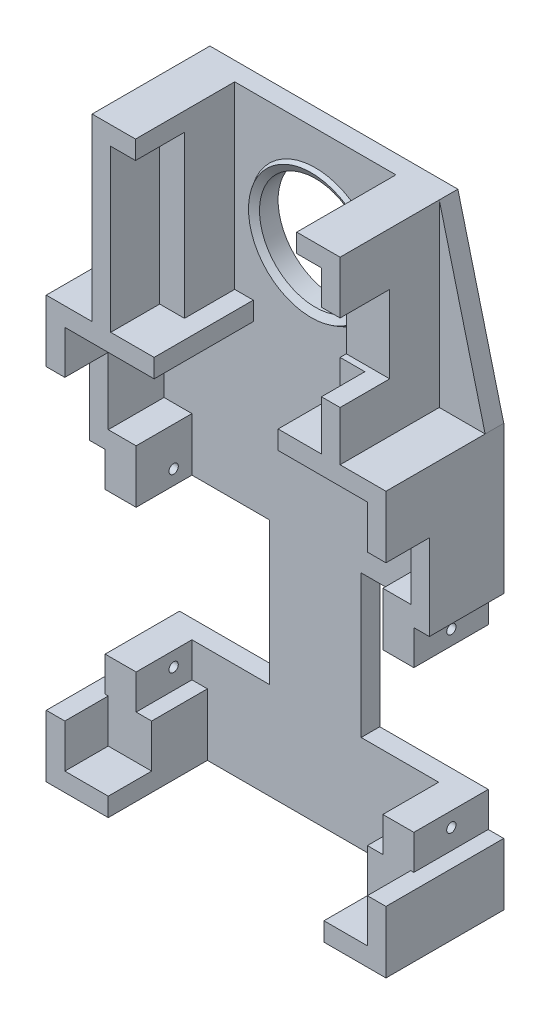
ISO-10303-21;
HEADER;
FILE_DESCRIPTION(('STEP AP214'),'2;1');
FILE_NAME('part.step','',(''),(''),'','','');
FILE_SCHEMA(('AUTOMOTIVE_DESIGN { 1 0 10303 214 1 1 1 1 }'));
ENDSEC;
DATA;
#1=APPLICATION_CONTEXT('core data for automotive mechanical design processes');
#2=APPLICATION_PROTOCOL_DEFINITION('international standard','automotive_design',2000,#1);
#3=PRODUCT_CONTEXT('',#1,'mechanical');
#4=PRODUCT('Part','Part','',(#3));
#5=PRODUCT_RELATED_PRODUCT_CATEGORY('part','',(#4));
#6=PRODUCT_DEFINITION_FORMATION('','',#4);
#7=PRODUCT_DEFINITION_CONTEXT('part definition',#1,'design');
#8=PRODUCT_DEFINITION('design','',#6,#7);
#9=PRODUCT_DEFINITION_SHAPE('','',#8);
#10=(LENGTH_UNIT() NAMED_UNIT(*) SI_UNIT(.MILLI.,.METRE.));
#11=(NAMED_UNIT(*) PLANE_ANGLE_UNIT() SI_UNIT($,.RADIAN.));
#12=(NAMED_UNIT(*) SI_UNIT($,.STERADIAN.) SOLID_ANGLE_UNIT());
#13=UNCERTAINTY_MEASURE_WITH_UNIT(LENGTH_MEASURE(1.E-05),#10,'distance_accuracy_value','');
#14=(GEOMETRIC_REPRESENTATION_CONTEXT(3) GLOBAL_UNCERTAINTY_ASSIGNED_CONTEXT((#13)) GLOBAL_UNIT_ASSIGNED_CONTEXT((#10,
#11,#12)) REPRESENTATION_CONTEXT('',''));
#15=CARTESIAN_POINT('',(0.,0.,0.));
#16=DIRECTION('',(0.,0.,1.));
#17=DIRECTION('',(1.,0.,0.));
#18=AXIS2_PLACEMENT_3D('',#15,#16,#17);
#19=CARTESIAN_POINT('',(0.,0.,12.));
#20=DIRECTION('',(0.,0.,1.));
#21=DIRECTION('',(1.,0.,0.));
#22=AXIS2_PLACEMENT_3D('',#19,#20,#21);
#23=PLANE('',#22);
#24=DIRECTION('',(1.,0.,0.));
#25=VECTOR('',#24,1.);
#26=CARTESIAN_POINT('',(20.,76.,12.));
#27=LINE('',#26,#25);
#28=CARTESIAN_POINT('',(13.,76.,12.));
#29=VERTEX_POINT('',#28);
#30=CARTESIAN_POINT('',(17.,76.,12.));
#31=VERTEX_POINT('',#30);
#32=EDGE_CURVE('E551',#29,#31,#27,.T.);
#33=ORIENTED_EDGE('',*,*,#32,.F.);
#34=DIRECTION('',(0.,-1.,0.));
#35=VECTOR('',#34,1.);
#36=CARTESIAN_POINT('',(13.,65.,12.));
#37=LINE('',#36,#35);
#38=CARTESIAN_POINT('',(13.,68.,12.));
#39=VERTEX_POINT('',#38);
#40=EDGE_CURVE('E837',#29,#39,#37,.T.);
#41=ORIENTED_EDGE('',*,*,#40,.T.);
#42=DIRECTION('',(1.,0.,0.));
#43=VECTOR('',#42,1.);
#44=CARTESIAN_POINT('',(0.,68.,12.));
#45=LINE('',#44,#43);
#46=CARTESIAN_POINT('',(17.,68.,12.));
#47=VERTEX_POINT('',#46);
#48=EDGE_CURVE('E1157',#39,#47,#45,.T.);
#49=ORIENTED_EDGE('',*,*,#48,.T.);
#50=DIRECTION('',(0.,1.,0.));
#51=VECTOR('',#50,1.);
#52=CARTESIAN_POINT('',(17.,0.,12.));
#53=LINE('',#52,#51);
#54=EDGE_CURVE('E1159',#47,#31,#53,.T.);
#55=ORIENTED_EDGE('',*,*,#54,.T.);
#56=EDGE_LOOP('',(#33,#41,#49,#55));
#57=FACE_BOUND('',#56,.T.);
#58=ADVANCED_FACE('F37',(#57),#23,.T.);
#59=DIRECTION('',(-1.,0.,0.));
#60=VECTOR('',#59,1.);
#61=CARTESIAN_POINT('',(20.,88.5,12.));
#62=LINE('',#61,#60);
#63=CARTESIAN_POINT('',(17.,88.5,12.));
#64=VERTEX_POINT('',#63);
#65=CARTESIAN_POINT('',(13.,88.5,12.));
#66=VERTEX_POINT('',#65);
#67=EDGE_CURVE('E546',#64,#66,#62,.T.);
#68=ORIENTED_EDGE('',*,*,#67,.F.);
#69=DIRECTION('',(0.,1.,0.));
#70=VECTOR('',#69,1.);
#71=CARTESIAN_POINT('',(17.,0.,12.));
#72=LINE('',#71,#70);
#73=CARTESIAN_POINT('',(17.,94.,12.));
#74=VERTEX_POINT('',#73);
#75=EDGE_CURVE('E54',#64,#74,#72,.T.);
#76=ORIENTED_EDGE('',*,*,#75,.T.);
#77=DIRECTION('',(-1.,0.,0.));
#78=VECTOR('',#77,1.);
#79=CARTESIAN_POINT('',(0.,94.,12.));
#80=LINE('',#79,#78);
#81=CARTESIAN_POINT('',(13.,94.,12.));
#82=VERTEX_POINT('',#81);
#83=EDGE_CURVE('E46',#74,#82,#80,.T.);
#84=ORIENTED_EDGE('',*,*,#83,.T.);
#85=EDGE_CURVE('E839',#82,#66,#37,.T.);
#86=ORIENTED_EDGE('',*,*,#85,.T.);
#87=EDGE_LOOP('',(#68,#76,#84,#86));
#88=FACE_BOUND('',#87,.T.);
#89=ADVANCED_FACE('F1378',(#88),#23,.T.);
#90=CARTESIAN_POINT('',(0.,0.,3.));
#91=DIRECTION('',(0.,0.,1.));
#92=DIRECTION('',(1.,0.,0.));
#93=AXIS2_PLACEMENT_3D('',#90,#91,#92);
#94=PLANE('',#93);
#95=CARTESIAN_POINT('',(0.,81.,3.));
#96=DIRECTION('',(0.,0.,1.));
#97=DIRECTION('',(1.,0.,0.));
#98=AXIS2_PLACEMENT_3D('',#95,#96,#97);
#99=CIRCLE('',#98,10.5);
#100=CARTESIAN_POINT('',(10.5,81.,3.));
#101=VERTEX_POINT('',#100);
#102=EDGE_CURVE('E12',#101,#101,#99,.T.);
#103=ORIENTED_EDGE('',*,*,#102,.F.);
#104=EDGE_LOOP('',(#103));
#105=FACE_BOUND('',#104,.T.);
#106=DIRECTION('',(0.,-1.,0.));
#107=VECTOR('',#106,1.);
#108=CARTESIAN_POINT('',(9.99999999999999,68.,3.));
#109=LINE('',#108,#107);
#110=CARTESIAN_POINT('',(9.99999999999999,68.,3.));
#111=VERTEX_POINT('',#110);
#112=CARTESIAN_POINT('',(9.99999999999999,65.,3.));
#113=VERTEX_POINT('',#112);
#114=EDGE_CURVE('E621',#111,#113,#109,.T.);
#115=ORIENTED_EDGE('',*,*,#114,.F.);
#116=DIRECTION('',(-1.,0.,0.));
#117=VECTOR('',#116,1.);
#118=CARTESIAN_POINT('',(17.,68.,3.));
#119=LINE('',#118,#117);
#120=CARTESIAN_POINT('',(13.,68.,3.));
#121=VERTEX_POINT('',#120);
#122=EDGE_CURVE('E616',#121,#111,#119,.T.);
#123=ORIENTED_EDGE('',*,*,#122,.F.);
#124=DIRECTION('',(0.,-1.,0.));
#125=VECTOR('',#124,1.);
#126=CARTESIAN_POINT('',(13.,65.,3.));
#127=LINE('',#126,#125);
#128=CARTESIAN_POINT('',(13.,97.,3.));
#129=VERTEX_POINT('',#128);
#130=EDGE_CURVE('E866',#129,#121,#127,.T.);
#131=ORIENTED_EDGE('',*,*,#130,.F.);
#132=DIRECTION('',(-1.,0.,0.));
#133=VECTOR('',#132,1.);
#134=CARTESIAN_POINT('',(20.,97.,3.));
#135=LINE('',#134,#133);
#136=CARTESIAN_POINT('',(-13.,97.,3.));
#137=VERTEX_POINT('',#136);
#138=EDGE_CURVE('E1007',#129,#137,#135,.T.);
#139=ORIENTED_EDGE('',*,*,#138,.T.);
#140=DIRECTION('',(0.,1.,0.));
#141=VECTOR('',#140,1.);
#142=CARTESIAN_POINT('',(-13.,65.,3.));
#143=LINE('',#142,#141);
#144=CARTESIAN_POINT('',(-13.,68.,3.));
#145=VERTEX_POINT('',#144);
#146=EDGE_CURVE('E954',#145,#137,#143,.T.);
#147=ORIENTED_EDGE('',*,*,#146,.F.);
#148=DIRECTION('',(-1.,0.,0.));
#149=VECTOR('',#148,1.);
#150=CARTESIAN_POINT('',(-17.,68.,3.));
#151=LINE('',#150,#149);
#152=CARTESIAN_POINT('',(-10.,68.,3.));
#153=VERTEX_POINT('',#152);
#154=EDGE_CURVE('E676',#153,#145,#151,.T.);
#155=ORIENTED_EDGE('',*,*,#154,.F.);
#156=DIRECTION('',(0.,1.,0.));
#157=VECTOR('',#156,1.);
#158=CARTESIAN_POINT('',(-10.,68.,3.));
#159=LINE('',#158,#157);
#160=CARTESIAN_POINT('',(-10.,65.,3.));
#161=VERTEX_POINT('',#160);
#162=EDGE_CURVE('E671',#161,#153,#159,.T.);
#163=ORIENTED_EDGE('',*,*,#162,.F.);
#164=DIRECTION('',(1.,0.,0.));
#165=VECTOR('',#164,1.);
#166=CARTESIAN_POINT('',(-17.4,65.,3.));
#167=LINE('',#166,#165);
#168=CARTESIAN_POINT('',(-17.4,65.,3.));
#169=VERTEX_POINT('',#168);
#170=EDGE_CURVE('E952',#169,#161,#167,.T.);
#171=ORIENTED_EDGE('',*,*,#170,.F.);
#172=DIRECTION('',(0.,1.,0.));
#173=VECTOR('',#172,1.);
#174=CARTESIAN_POINT('',(-17.4,65.,3.));
#175=LINE('',#174,#173);
#176=CARTESIAN_POINT('',(-17.4,58.,3.));
#177=VERTEX_POINT('',#176);
#178=EDGE_CURVE('E949',#177,#169,#175,.T.);
#179=ORIENTED_EDGE('',*,*,#178,.F.);
#180=DIRECTION('',(1.,0.,0.));
#181=VECTOR('',#180,1.);
#182=CARTESIAN_POINT('',(-24.4,58.,3.));
#183=LINE('',#182,#181);
#184=CARTESIAN_POINT('',(-24.4,58.,3.));
#185=VERTEX_POINT('',#184);
#186=EDGE_CURVE('E946',#185,#177,#183,.T.);
#187=ORIENTED_EDGE('',*,*,#186,.F.);
#188=DIRECTION('',(0.,1.,0.));
#189=VECTOR('',#188,1.);
#190=CARTESIAN_POINT('',(-24.4,58.,3.));
#191=LINE('',#190,#189);
#192=CARTESIAN_POINT('',(-24.4,47.2,3.));
#193=VERTEX_POINT('',#192);
#194=EDGE_CURVE('E943',#193,#185,#191,.T.);
#195=ORIENTED_EDGE('',*,*,#194,.F.);
#196=DIRECTION('',(-1.,0.,0.));
#197=VECTOR('',#196,1.);
#198=CARTESIAN_POINT('',(-24.4,47.2,3.));
#199=LINE('',#198,#197);
#200=CARTESIAN_POINT('',(-19.9,47.2,3.));
#201=VERTEX_POINT('',#200);
#202=EDGE_CURVE('E940',#201,#193,#199,.T.);
#203=ORIENTED_EDGE('',*,*,#202,.F.);
#204=DIRECTION('',(0.,1.,0.));
#205=VECTOR('',#204,1.);
#206=CARTESIAN_POINT('',(-19.9,38.6,3.));
#207=LINE('',#206,#205);
#208=CARTESIAN_POINT('',(-19.9,38.6,3.));
#209=VERTEX_POINT('',#208);
#210=EDGE_CURVE('E914',#209,#201,#207,.T.);
#211=ORIENTED_EDGE('',*,*,#210,.F.);
#212=DIRECTION('',(1.,0.,0.));
#213=VECTOR('',#212,1.);
#214=CARTESIAN_POINT('',(-24.9,38.6,3.));
#215=LINE('',#214,#213);
#216=CARTESIAN_POINT('',(-7.4,38.6,3.));
#217=VERTEX_POINT('',#216);
#218=EDGE_CURVE('E1012',#209,#217,#215,.T.);
#219=ORIENTED_EDGE('',*,*,#218,.T.);
#220=DIRECTION('',(0.,-1.,0.));
#221=VECTOR('',#220,1.);
#222=CARTESIAN_POINT('',(-7.4,38.6,3.));
#223=LINE('',#222,#221);
#224=CARTESIAN_POINT('',(-7.4,15.6,3.));
#225=VERTEX_POINT('',#224);
#226=EDGE_CURVE('E1014',#217,#225,#223,.T.);
#227=ORIENTED_EDGE('',*,*,#226,.T.);
#228=DIRECTION('',(-1.,0.,0.));
#229=VECTOR('',#228,1.);
#230=CARTESIAN_POINT('',(-7.4,15.6,3.));
#231=LINE('',#230,#229);
#232=CARTESIAN_POINT('',(-19.9,15.6,3.));
#233=VERTEX_POINT('',#232);
#234=EDGE_CURVE('E1016',#225,#233,#231,.T.);
#235=ORIENTED_EDGE('',*,*,#234,.T.);
#236=DIRECTION('',(0.,1.,0.));
#237=VECTOR('',#236,1.);
#238=CARTESIAN_POINT('',(-19.9,15.6,3.));
#239=LINE('',#238,#237);
#240=CARTESIAN_POINT('',(-19.9,10.,3.));
#241=VERTEX_POINT('',#240);
#242=EDGE_CURVE('E806',#241,#233,#239,.T.);
#243=ORIENTED_EDGE('',*,*,#242,.F.);
#244=DIRECTION('',(-1.,0.,0.));
#245=VECTOR('',#244,1.);
#246=CARTESIAN_POINT('',(-19.9,10.,3.));
#247=LINE('',#246,#245);
#248=CARTESIAN_POINT('',(-17.4,10.,3.));
#249=VERTEX_POINT('',#248);
#250=EDGE_CURVE('E818',#249,#241,#247,.T.);
#251=ORIENTED_EDGE('',*,*,#250,.F.);
#252=DIRECTION('',(0.,1.,0.));
#253=VECTOR('',#252,1.);
#254=CARTESIAN_POINT('',(-17.4,0.,3.));
#255=LINE('',#254,#253);
#256=CARTESIAN_POINT('',(-17.4,0.,3.));
#257=VERTEX_POINT('',#256);
#258=EDGE_CURVE('E802',#257,#249,#255,.T.);
#259=ORIENTED_EDGE('',*,*,#258,.F.);
#260=DIRECTION('',(1.,0.,0.));
#261=VECTOR('',#260,1.);
#262=CARTESIAN_POINT('',(-27.4,0.,3.));
#263=LINE('',#262,#261);
#264=CARTESIAN_POINT('',(17.4,0.,3.));
#265=VERTEX_POINT('',#264);
#266=EDGE_CURVE('E994',#257,#265,#263,.T.);
#267=ORIENTED_EDGE('',*,*,#266,.T.);
#268=DIRECTION('',(0.,-1.,0.));
#269=VECTOR('',#268,1.);
#270=CARTESIAN_POINT('',(17.4,0.,3.));
#271=LINE('',#270,#269);
#272=CARTESIAN_POINT('',(17.4,10.,3.));
#273=VERTEX_POINT('',#272);
#274=EDGE_CURVE('E776',#273,#265,#271,.T.);
#275=ORIENTED_EDGE('',*,*,#274,.F.);
#276=DIRECTION('',(-1.,0.,0.));
#277=VECTOR('',#276,1.);
#278=CARTESIAN_POINT('',(19.9,10.,3.));
#279=LINE('',#278,#277);
#280=CARTESIAN_POINT('',(19.9,10.,3.));
#281=VERTEX_POINT('',#280);
#282=EDGE_CURVE('E787',#281,#273,#279,.T.);
#283=ORIENTED_EDGE('',*,*,#282,.F.);
#284=DIRECTION('',(0.,-1.,0.));
#285=VECTOR('',#284,1.);
#286=CARTESIAN_POINT('',(19.9,15.6,3.));
#287=LINE('',#286,#285);
#288=CARTESIAN_POINT('',(19.9,15.6,3.));
#289=VERTEX_POINT('',#288);
#290=EDGE_CURVE('E771',#289,#281,#287,.T.);
#291=ORIENTED_EDGE('',*,*,#290,.F.);
#292=DIRECTION('',(-1.,0.,0.));
#293=VECTOR('',#292,1.);
#294=CARTESIAN_POINT('',(24.9,15.6,3.));
#295=LINE('',#294,#293);
#296=CARTESIAN_POINT('',(7.4,15.6,3.));
#297=VERTEX_POINT('',#296);
#298=EDGE_CURVE('E997',#289,#297,#295,.T.);
#299=ORIENTED_EDGE('',*,*,#298,.T.);
#300=DIRECTION('',(0.,1.,0.));
#301=VECTOR('',#300,1.);
#302=CARTESIAN_POINT('',(7.4,15.6,3.));
#303=LINE('',#302,#301);
#304=CARTESIAN_POINT('',(7.4,38.6,3.));
#305=VERTEX_POINT('',#304);
#306=EDGE_CURVE('E1000',#297,#305,#303,.T.);
#307=ORIENTED_EDGE('',*,*,#306,.T.);
#308=DIRECTION('',(1.,0.,0.));
#309=VECTOR('',#308,1.);
#310=CARTESIAN_POINT('',(7.4,38.6,3.));
#311=LINE('',#310,#309);
#312=CARTESIAN_POINT('',(19.9,38.6,3.));
#313=VERTEX_POINT('',#312);
#314=EDGE_CURVE('E1002',#305,#313,#311,.T.);
#315=ORIENTED_EDGE('',*,*,#314,.T.);
#316=DIRECTION('',(0.,-1.,0.));
#317=VECTOR('',#316,1.);
#318=CARTESIAN_POINT('',(19.9,38.6,3.));
#319=LINE('',#318,#317);
#320=CARTESIAN_POINT('',(19.9,47.2,3.));
#321=VERTEX_POINT('',#320);
#322=EDGE_CURVE('E838',#321,#313,#319,.T.);
#323=ORIENTED_EDGE('',*,*,#322,.F.);
#324=DIRECTION('',(-1.,0.,0.));
#325=VECTOR('',#324,1.);
#326=CARTESIAN_POINT('',(24.4,47.2,3.));
#327=LINE('',#326,#325);
#328=CARTESIAN_POINT('',(24.4,47.2,3.));
#329=VERTEX_POINT('',#328);
#330=EDGE_CURVE('E880',#329,#321,#327,.T.);
#331=ORIENTED_EDGE('',*,*,#330,.F.);
#332=DIRECTION('',(0.,-1.,0.));
#333=VECTOR('',#332,1.);
#334=CARTESIAN_POINT('',(24.4,58.,3.));
#335=LINE('',#334,#333);
#336=CARTESIAN_POINT('',(24.4,58.,3.));
#337=VERTEX_POINT('',#336);
#338=EDGE_CURVE('E877',#337,#329,#335,.T.);
#339=ORIENTED_EDGE('',*,*,#338,.F.);
#340=DIRECTION('',(1.,0.,0.));
#341=VECTOR('',#340,1.);
#342=CARTESIAN_POINT('',(24.4,58.,3.));
#343=LINE('',#342,#341);
#344=CARTESIAN_POINT('',(17.4,58.,3.));
#345=VERTEX_POINT('',#344);
#346=EDGE_CURVE('E874',#345,#337,#343,.T.);
#347=ORIENTED_EDGE('',*,*,#346,.F.);
#348=DIRECTION('',(0.,-1.,0.));
#349=VECTOR('',#348,1.);
#350=CARTESIAN_POINT('',(17.4,65.,3.));
#351=LINE('',#350,#349);
#352=CARTESIAN_POINT('',(17.4,65.,3.));
#353=VERTEX_POINT('',#352);
#354=EDGE_CURVE('E871',#353,#345,#351,.T.);
#355=ORIENTED_EDGE('',*,*,#354,.F.);
#356=DIRECTION('',(1.,0.,0.));
#357=VECTOR('',#356,1.);
#358=CARTESIAN_POINT('',(17.4,65.,3.));
#359=LINE('',#358,#357);
#360=EDGE_CURVE('E868',#113,#353,#359,.T.);
#361=ORIENTED_EDGE('',*,*,#360,.F.);
#362=EDGE_LOOP('',(#115,#123,#131,#139,#147,#155,#163,#171,#179,#187,#195,#203,#211,#219,#227,
#235,#243,#251,#259,#267,#275,#283,#291,#299,#307,#315,#323,#331,#339,#347,#355,#361));
#363=FACE_BOUND('',#362,.T.);
#364=ADVANCED_FACE('F1209',(#105,#363),#94,.T.);
#365=CARTESIAN_POINT('',(13.,65.,12.));
#366=DIRECTION('',(1.,0.,0.));
#367=DIRECTION('',(0.,0.,-1.));
#368=AXIS2_PLACEMENT_3D('',#365,#366,#367);
#369=PLANE('',#368);
#370=ORIENTED_EDGE('',*,*,#40,.F.);
#371=DIRECTION('',(0.,0.,1.));
#372=VECTOR('',#371,1.);
#373=CARTESIAN_POINT('',(13.,76.,11.));
#374=LINE('',#373,#372);
#375=CARTESIAN_POINT('',(13.,76.,11.));
#376=VERTEX_POINT('',#375);
#377=EDGE_CURVE('E562',#376,#29,#374,.T.);
#378=ORIENTED_EDGE('',*,*,#377,.F.);
#379=DIRECTION('',(0.,-1.,0.));
#380=VECTOR('',#379,1.);
#381=CARTESIAN_POINT('',(13.,88.5,11.));
#382=LINE('',#381,#380);
#383=CARTESIAN_POINT('',(13.,88.5,11.));
#384=VERTEX_POINT('',#383);
#385=EDGE_CURVE('E554',#384,#376,#382,.T.);
#386=ORIENTED_EDGE('',*,*,#385,.F.);
#387=DIRECTION('',(0.,0.,1.));
#388=VECTOR('',#387,1.);
#389=CARTESIAN_POINT('',(13.,88.5,11.));
#390=LINE('',#389,#388);
#391=EDGE_CURVE('E559',#384,#66,#390,.T.);
#392=ORIENTED_EDGE('',*,*,#391,.T.);
#393=ORIENTED_EDGE('',*,*,#85,.F.);
#394=DIRECTION('',(0.,0.,-1.));
#395=VECTOR('',#394,1.);
#396=CARTESIAN_POINT('',(13.,94.,19.));
#397=LINE('',#396,#395);
#398=CARTESIAN_POINT('',(13.,94.,19.));
#399=VERTEX_POINT('',#398);
#400=EDGE_CURVE('E613',#399,#82,#397,.T.);
#401=ORIENTED_EDGE('',*,*,#400,.F.);
#402=DIRECTION('',(0.,-1.,0.));
#403=VECTOR('',#402,1.);
#404=CARTESIAN_POINT('',(13.,97.,19.));
#405=LINE('',#404,#403);
#406=CARTESIAN_POINT('',(13.,97.,19.));
#407=VERTEX_POINT('',#406);
#408=EDGE_CURVE('E594',#407,#399,#405,.T.);
#409=ORIENTED_EDGE('',*,*,#408,.F.);
#410=DIRECTION('',(0.,0.,-1.));
#411=VECTOR('',#410,1.);
#412=CARTESIAN_POINT('',(13.,97.,12.));
#413=LINE('',#412,#411);
#414=EDGE_CURVE('E902',#407,#129,#413,.T.);
#415=ORIENTED_EDGE('',*,*,#414,.T.);
#416=ORIENTED_EDGE('',*,*,#130,.T.);
#417=DIRECTION('',(0.,0.,-1.));
#418=VECTOR('',#417,1.);
#419=CARTESIAN_POINT('',(13.,68.,12.));
#420=LINE('',#419,#418);
#421=EDGE_CURVE('E668',#39,#121,#420,.T.);
#422=ORIENTED_EDGE('',*,*,#421,.F.);
#423=EDGE_LOOP('',(#370,#378,#386,#392,#393,#401,#409,#415,#416,#422));
#424=FACE_BOUND('',#423,.T.);
#425=ADVANCED_FACE('F1262',(#424),#369,.F.);
#426=DIRECTION('',(0.,1.,0.));
#427=VECTOR('',#426,1.);
#428=CARTESIAN_POINT('',(27.4,68.,12.));
#429=LINE('',#428,#427);
#430=CARTESIAN_POINT('',(27.4,44.2,12.));
#431=VERTEX_POINT('',#430);
#432=CARTESIAN_POINT('',(27.4,58.,12.));
#433=VERTEX_POINT('',#432);
#434=EDGE_CURVE('E835',#431,#433,#429,.T.);
#435=ORIENTED_EDGE('',*,*,#434,.T.);
#436=DIRECTION('',(-1.,0.,0.));
#437=VECTOR('',#436,1.);
#438=CARTESIAN_POINT('',(0.,58.,12.));
#439=LINE('',#438,#437);
#440=CARTESIAN_POINT('',(24.4,58.,12.));
#441=VERTEX_POINT('',#440);
#442=EDGE_CURVE('E1155',#433,#441,#439,.T.);
#443=ORIENTED_EDGE('',*,*,#442,.T.);
#444=DIRECTION('',(0.,-1.,0.));
#445=VECTOR('',#444,1.);
#446=CARTESIAN_POINT('',(24.4,58.,12.));
#447=LINE('',#446,#445);
#448=CARTESIAN_POINT('',(24.4,47.2,12.));
#449=VERTEX_POINT('',#448);
#450=EDGE_CURVE('E846',#441,#449,#447,.T.);
#451=ORIENTED_EDGE('',*,*,#450,.T.);
#452=DIRECTION('',(-1.,0.,0.));
#453=VECTOR('',#452,1.);
#454=CARTESIAN_POINT('',(24.4,47.2,12.));
#455=LINE('',#454,#453);
#456=CARTESIAN_POINT('',(19.9,47.2,12.));
#457=VERTEX_POINT('',#456);
#458=EDGE_CURVE('E848',#449,#457,#455,.T.);
#459=ORIENTED_EDGE('',*,*,#458,.T.);
#460=DIRECTION('',(0.,-1.,0.));
#461=VECTOR('',#460,1.);
#462=CARTESIAN_POINT('',(19.9,38.6,12.));
#463=LINE('',#462,#461);
#464=CARTESIAN_POINT('',(19.9,38.6,12.));
#465=VERTEX_POINT('',#464);
#466=EDGE_CURVE('E850',#457,#465,#463,.T.);
#467=ORIENTED_EDGE('',*,*,#466,.T.);
#468=DIRECTION('',(1.,0.,0.));
#469=VECTOR('',#468,1.);
#470=CARTESIAN_POINT('',(24.9,38.6,12.));
#471=LINE('',#470,#469);
#472=CARTESIAN_POINT('',(24.9,38.6,12.));
#473=VERTEX_POINT('',#472);
#474=EDGE_CURVE('E852',#465,#473,#471,.T.);
#475=ORIENTED_EDGE('',*,*,#474,.T.);
#476=DIRECTION('',(0.,1.,0.));
#477=VECTOR('',#476,1.);
#478=CARTESIAN_POINT('',(24.9,38.6,12.));
#479=LINE('',#478,#477);
#480=CARTESIAN_POINT('',(24.9,44.2,12.));
#481=VERTEX_POINT('',#480);
#482=EDGE_CURVE('E855',#473,#481,#479,.T.);
#483=ORIENTED_EDGE('',*,*,#482,.T.);
#484=DIRECTION('',(1.,0.,0.));
#485=VECTOR('',#484,1.);
#486=CARTESIAN_POINT('',(24.9,44.2,12.));
#487=LINE('',#486,#485);
#488=EDGE_CURVE('E858',#481,#431,#487,.T.);
#489=ORIENTED_EDGE('',*,*,#488,.T.);
#490=EDGE_LOOP('',(#435,#443,#451,#459,#467,#475,#483,#489));
#491=FACE_BOUND('',#490,.T.);
#492=ADVANCED_FACE('F1381',(#491),#23,.T.);
#493=DIRECTION('',(1.,0.,0.));
#494=VECTOR('',#493,1.);
#495=CARTESIAN_POINT('',(24.4,58.,12.));
#496=LINE('',#495,#494);
#497=CARTESIAN_POINT('',(17.4,58.,12.));
#498=VERTEX_POINT('',#497);
#499=EDGE_CURVE('E843',#498,#441,#496,.T.);
#500=ORIENTED_EDGE('',*,*,#499,.T.);
#501=DIRECTION('',(0.,1.,0.));
#502=VECTOR('',#501,1.);
#503=CARTESIAN_POINT('',(24.4,0.,12.));
#504=LINE('',#503,#502);
#505=CARTESIAN_POINT('',(24.4,65.,12.));
#506=VERTEX_POINT('',#505);
#507=EDGE_CURVE('E1153',#441,#506,#504,.T.);
#508=ORIENTED_EDGE('',*,*,#507,.T.);
#509=DIRECTION('',(-1.,0.,0.));
#510=VECTOR('',#509,1.);
#511=CARTESIAN_POINT('',(0.,65.,12.));
#512=LINE('',#511,#510);
#513=CARTESIAN_POINT('',(17.4,65.,12.));
#514=VERTEX_POINT('',#513);
#515=EDGE_CURVE('E1150',#506,#514,#512,.T.);
#516=ORIENTED_EDGE('',*,*,#515,.T.);
#517=DIRECTION('',(0.,-1.,0.));
#518=VECTOR('',#517,1.);
#519=CARTESIAN_POINT('',(17.4,65.,12.));
#520=LINE('',#519,#518);
#521=EDGE_CURVE('E841',#514,#498,#520,.T.);
#522=ORIENTED_EDGE('',*,*,#521,.T.);
#523=EDGE_LOOP('',(#500,#508,#516,#522));
#524=FACE_BOUND('',#523,.T.);
#525=ADVANCED_FACE('F1235',(#524),#23,.T.);
#526=CARTESIAN_POINT('',(0.,0.,12.));
#527=DIRECTION('',(0.,0.,-1.));
#528=DIRECTION('',(-1.,0.,0.));
#529=AXIS2_PLACEMENT_3D('',#526,#527,#528);
#530=PLANE('',#529);
#531=DIRECTION('',(1.,0.,0.));
#532=VECTOR('',#531,1.);
#533=CARTESIAN_POINT('',(0.,58.,12.));
#534=LINE('',#533,#532);
#535=CARTESIAN_POINT('',(-27.4,58.,12.));
#536=VERTEX_POINT('',#535);
#537=CARTESIAN_POINT('',(-24.4,58.,12.));
#538=VERTEX_POINT('',#537);
#539=EDGE_CURVE('E1147',#536,#538,#534,.T.);
#540=ORIENTED_EDGE('',*,*,#539,.F.);
#541=DIRECTION('',(0.,-1.,0.));
#542=VECTOR('',#541,1.);
#543=CARTESIAN_POINT('',(-27.4,68.,12.));
#544=LINE('',#543,#542);
#545=CARTESIAN_POINT('',(-27.4,44.2,12.));
#546=VERTEX_POINT('',#545);
#547=EDGE_CURVE('E915',#536,#546,#544,.T.);
#548=ORIENTED_EDGE('',*,*,#547,.T.);
#549=DIRECTION('',(1.,0.,0.));
#550=VECTOR('',#549,1.);
#551=CARTESIAN_POINT('',(-24.9,44.2,12.));
#552=LINE('',#551,#550);
#553=CARTESIAN_POINT('',(-24.9,44.2,12.));
#554=VERTEX_POINT('',#553);
#555=EDGE_CURVE('E917',#546,#554,#552,.T.);
#556=ORIENTED_EDGE('',*,*,#555,.T.);
#557=DIRECTION('',(0.,-1.,0.));
#558=VECTOR('',#557,1.);
#559=CARTESIAN_POINT('',(-24.9,38.6,12.));
#560=LINE('',#559,#558);
#561=CARTESIAN_POINT('',(-24.9,38.6,12.));
#562=VERTEX_POINT('',#561);
#563=EDGE_CURVE('E921',#554,#562,#560,.T.);
#564=ORIENTED_EDGE('',*,*,#563,.T.);
#565=DIRECTION('',(1.,0.,0.));
#566=VECTOR('',#565,1.);
#567=CARTESIAN_POINT('',(-24.9,38.6,12.));
#568=LINE('',#567,#566);
#569=CARTESIAN_POINT('',(-19.9,38.6,12.));
#570=VERTEX_POINT('',#569);
#571=EDGE_CURVE('E924',#562,#570,#568,.T.);
#572=ORIENTED_EDGE('',*,*,#571,.T.);
#573=DIRECTION('',(0.,1.,0.));
#574=VECTOR('',#573,1.);
#575=CARTESIAN_POINT('',(-19.9,38.6,12.));
#576=LINE('',#575,#574);
#577=CARTESIAN_POINT('',(-19.9,47.2,12.));
#578=VERTEX_POINT('',#577);
#579=EDGE_CURVE('E926',#570,#578,#576,.T.);
#580=ORIENTED_EDGE('',*,*,#579,.T.);
#581=DIRECTION('',(-1.,0.,0.));
#582=VECTOR('',#581,1.);
#583=CARTESIAN_POINT('',(-24.4,47.2,12.));
#584=LINE('',#583,#582);
#585=CARTESIAN_POINT('',(-24.4,47.2,12.));
#586=VERTEX_POINT('',#585);
#587=EDGE_CURVE('E928',#578,#586,#584,.T.);
#588=ORIENTED_EDGE('',*,*,#587,.T.);
#589=DIRECTION('',(0.,1.,0.));
#590=VECTOR('',#589,1.);
#591=CARTESIAN_POINT('',(-24.4,58.,12.));
#592=LINE('',#591,#590);
#593=EDGE_CURVE('E930',#586,#538,#592,.T.);
#594=ORIENTED_EDGE('',*,*,#593,.T.);
#595=EDGE_LOOP('',(#540,#548,#556,#564,#572,#580,#588,#594));
#596=FACE_BOUND('',#595,.T.);
#597=ADVANCED_FACE('F1394',(#596),#530,.F.);
#598=DIRECTION('',(0.,1.,0.));
#599=VECTOR('',#598,1.);
#600=CARTESIAN_POINT('',(-24.4,0.,12.));
#601=LINE('',#600,#599);
#602=CARTESIAN_POINT('',(-24.4,65.,12.));
#603=VERTEX_POINT('',#602);
#604=EDGE_CURVE('E1144',#538,#603,#601,.T.);
#605=ORIENTED_EDGE('',*,*,#604,.F.);
#606=DIRECTION('',(1.,0.,0.));
#607=VECTOR('',#606,1.);
#608=CARTESIAN_POINT('',(-24.4,58.,12.));
#609=LINE('',#608,#607);
#610=CARTESIAN_POINT('',(-17.4,58.,12.));
#611=VERTEX_POINT('',#610);
#612=EDGE_CURVE('E933',#538,#611,#609,.T.);
#613=ORIENTED_EDGE('',*,*,#612,.T.);
#614=DIRECTION('',(0.,1.,0.));
#615=VECTOR('',#614,1.);
#616=CARTESIAN_POINT('',(-17.4,65.,12.));
#617=LINE('',#616,#615);
#618=CARTESIAN_POINT('',(-17.4,65.,12.));
#619=VERTEX_POINT('',#618);
#620=EDGE_CURVE('E935',#611,#619,#617,.T.);
#621=ORIENTED_EDGE('',*,*,#620,.T.);
#622=DIRECTION('',(1.,0.,0.));
#623=VECTOR('',#622,1.);
#624=CARTESIAN_POINT('',(0.,65.,12.));
#625=LINE('',#624,#623);
#626=EDGE_CURVE('E1141',#603,#619,#625,.T.);
#627=ORIENTED_EDGE('',*,*,#626,.F.);
#628=EDGE_LOOP('',(#605,#613,#621,#627));
#629=FACE_BOUND('',#628,.T.);
#630=ADVANCED_FACE('F1474',(#629),#530,.F.);
#631=CARTESIAN_POINT('',(0.,0.,12.));
#632=DIRECTION('',(0.,0.,1.));
#633=DIRECTION('',(1.,0.,0.));
#634=AXIS2_PLACEMENT_3D('',#631,#632,#633);
#635=PLANE('',#634);
#636=DIRECTION('',(0.,1.,0.));
#637=VECTOR('',#636,1.);
#638=CARTESIAN_POINT('',(24.4,0.,12.));
#639=LINE('',#638,#637);
#640=CARTESIAN_POINT('',(24.4,3.,12.));
#641=VERTEX_POINT('',#640);
#642=CARTESIAN_POINT('',(24.4,10.,12.));
#643=VERTEX_POINT('',#642);
#644=EDGE_CURVE('E1137',#641,#643,#639,.T.);
#645=ORIENTED_EDGE('',*,*,#644,.T.);
#646=DIRECTION('',(1.,0.,0.));
#647=VECTOR('',#646,1.);
#648=CARTESIAN_POINT('',(0.,10.,12.));
#649=LINE('',#648,#647);
#650=CARTESIAN_POINT('',(24.9,10.,12.));
#651=VERTEX_POINT('',#650);
#652=EDGE_CURVE('E1139',#643,#651,#649,.T.);
#653=ORIENTED_EDGE('',*,*,#652,.T.);
#654=DIRECTION('',(0.,1.,0.));
#655=VECTOR('',#654,1.);
#656=CARTESIAN_POINT('',(24.9,15.6,12.));
#657=LINE('',#656,#655);
#658=CARTESIAN_POINT('',(24.9,15.6,12.));
#659=VERTEX_POINT('',#658);
#660=EDGE_CURVE('E772',#651,#659,#657,.T.);
#661=ORIENTED_EDGE('',*,*,#660,.T.);
#662=DIRECTION('',(-1.,0.,0.));
#663=VECTOR('',#662,1.);
#664=CARTESIAN_POINT('',(24.9,15.6,12.));
#665=LINE('',#664,#663);
#666=CARTESIAN_POINT('',(19.9,15.6,12.));
#667=VERTEX_POINT('',#666);
#668=EDGE_CURVE('E775',#659,#667,#665,.T.);
#669=ORIENTED_EDGE('',*,*,#668,.T.);
#670=DIRECTION('',(0.,-1.,0.));
#671=VECTOR('',#670,1.);
#672=CARTESIAN_POINT('',(19.9,15.6,12.));
#673=LINE('',#672,#671);
#674=CARTESIAN_POINT('',(19.9,10.,12.));
#675=VERTEX_POINT('',#674);
#676=EDGE_CURVE('E778',#667,#675,#673,.T.);
#677=ORIENTED_EDGE('',*,*,#676,.T.);
#678=DIRECTION('',(-1.,0.,0.));
#679=VECTOR('',#678,1.);
#680=CARTESIAN_POINT('',(19.9,10.,12.));
#681=LINE('',#680,#679);
#682=CARTESIAN_POINT('',(17.4,10.,12.));
#683=VERTEX_POINT('',#682);
#684=EDGE_CURVE('E780',#675,#683,#681,.T.);
#685=ORIENTED_EDGE('',*,*,#684,.T.);
#686=DIRECTION('',(0.,-1.,0.));
#687=VECTOR('',#686,1.);
#688=CARTESIAN_POINT('',(17.4,0.,12.));
#689=LINE('',#688,#687);
#690=CARTESIAN_POINT('',(17.4,3.,12.));
#691=VERTEX_POINT('',#690);
#692=EDGE_CURVE('E782',#683,#691,#689,.T.);
#693=ORIENTED_EDGE('',*,*,#692,.T.);
#694=DIRECTION('',(1.,0.,0.));
#695=VECTOR('',#694,1.);
#696=CARTESIAN_POINT('',(0.,3.,12.));
#697=LINE('',#696,#695);
#698=EDGE_CURVE('E1135',#691,#641,#697,.T.);
#699=ORIENTED_EDGE('',*,*,#698,.T.);
#700=EDGE_LOOP('',(#645,#653,#661,#669,#677,#685,#693,#699));
#701=FACE_BOUND('',#700,.T.);
#702=ADVANCED_FACE('F1359',(#701),#635,.T.);
#703=CARTESIAN_POINT('',(0.,0.,12.));
#704=DIRECTION('',(0.,0.,-1.));
#705=DIRECTION('',(-1.,0.,0.));
#706=AXIS2_PLACEMENT_3D('',#703,#704,#705);
#707=PLANE('',#706);
#708=DIRECTION('',(-1.,0.,0.));
#709=VECTOR('',#708,1.);
#710=CARTESIAN_POINT('',(0.,3.,12.));
#711=LINE('',#710,#709);
#712=CARTESIAN_POINT('',(-17.4,3.,12.));
#713=VERTEX_POINT('',#712);
#714=CARTESIAN_POINT('',(-24.4,3.,12.));
#715=VERTEX_POINT('',#714);
#716=EDGE_CURVE('E1132',#713,#715,#711,.T.);
#717=ORIENTED_EDGE('',*,*,#716,.F.);
#718=DIRECTION('',(0.,1.,0.));
#719=VECTOR('',#718,1.);
#720=CARTESIAN_POINT('',(-17.4,0.,12.));
#721=LINE('',#720,#719);
#722=CARTESIAN_POINT('',(-17.4,10.,12.));
#723=VERTEX_POINT('',#722);
#724=EDGE_CURVE('E803',#713,#723,#721,.T.);
#725=ORIENTED_EDGE('',*,*,#724,.T.);
#726=DIRECTION('',(-1.,0.,0.));
#727=VECTOR('',#726,1.);
#728=CARTESIAN_POINT('',(-19.9,10.,12.));
#729=LINE('',#728,#727);
#730=CARTESIAN_POINT('',(-19.9,10.,12.));
#731=VERTEX_POINT('',#730);
#732=EDGE_CURVE('E805',#723,#731,#729,.T.);
#733=ORIENTED_EDGE('',*,*,#732,.T.);
#734=DIRECTION('',(0.,1.,0.));
#735=VECTOR('',#734,1.);
#736=CARTESIAN_POINT('',(-19.9,15.6,12.));
#737=LINE('',#736,#735);
#738=CARTESIAN_POINT('',(-19.9,15.6,12.));
#739=VERTEX_POINT('',#738);
#740=EDGE_CURVE('E808',#731,#739,#737,.T.);
#741=ORIENTED_EDGE('',*,*,#740,.T.);
#742=DIRECTION('',(-1.,0.,0.));
#743=VECTOR('',#742,1.);
#744=CARTESIAN_POINT('',(-24.9,15.6,12.));
#745=LINE('',#744,#743);
#746=CARTESIAN_POINT('',(-24.9,15.6,12.));
#747=VERTEX_POINT('',#746);
#748=EDGE_CURVE('E810',#739,#747,#745,.T.);
#749=ORIENTED_EDGE('',*,*,#748,.T.);
#750=DIRECTION('',(0.,-1.,0.));
#751=VECTOR('',#750,1.);
#752=CARTESIAN_POINT('',(-24.9,15.6,12.));
#753=LINE('',#752,#751);
#754=CARTESIAN_POINT('',(-24.9,10.,12.));
#755=VERTEX_POINT('',#754);
#756=EDGE_CURVE('E813',#747,#755,#753,.T.);
#757=ORIENTED_EDGE('',*,*,#756,.T.);
#758=DIRECTION('',(-1.,0.,0.));
#759=VECTOR('',#758,1.);
#760=CARTESIAN_POINT('',(0.,10.,12.));
#761=LINE('',#760,#759);
#762=CARTESIAN_POINT('',(-24.4,10.,12.));
#763=VERTEX_POINT('',#762);
#764=EDGE_CURVE('E1126',#763,#755,#761,.T.);
#765=ORIENTED_EDGE('',*,*,#764,.F.);
#766=DIRECTION('',(0.,1.,0.));
#767=VECTOR('',#766,1.);
#768=CARTESIAN_POINT('',(-24.4,0.,12.));
#769=LINE('',#768,#767);
#770=EDGE_CURVE('E1129',#715,#763,#769,.T.);
#771=ORIENTED_EDGE('',*,*,#770,.F.);
#772=EDGE_LOOP('',(#717,#725,#733,#741,#749,#757,#765,#771));
#773=FACE_BOUND('',#772,.T.);
#774=ADVANCED_FACE('F1473',(#773),#707,.F.);
#775=DIRECTION('',(0.,1.,0.));
#776=VECTOR('',#775,1.);
#777=CARTESIAN_POINT('',(20.,68.,3.));
#778=LINE('',#777,#776);
#779=CARTESIAN_POINT('',(20.,68.,3.));
#780=VERTEX_POINT('',#779);
#781=CARTESIAN_POINT('',(20.,97.,3.));
#782=VERTEX_POINT('',#781);
#783=EDGE_CURVE('E864',#780,#782,#778,.T.);
#784=ORIENTED_EDGE('',*,*,#783,.F.);
#785=DIRECTION('',(-1.,0.,0.));
#786=VECTOR('',#785,1.);
#787=CARTESIAN_POINT('',(27.4,68.,3.));
#788=LINE('',#787,#786);
#789=CARTESIAN_POINT('',(27.4,68.,3.));
#790=VERTEX_POINT('',#789);
#791=EDGE_CURVE('E834',#790,#780,#788,.T.);
#792=ORIENTED_EDGE('',*,*,#791,.F.);
#793=DIRECTION('',(-0.247249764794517,0.968951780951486,0.));
#794=VECTOR('',#793,1.);
#795=CARTESIAN_POINT('',(27.4,68.,3.));
#796=LINE('',#795,#794);
#797=EDGE_CURVE('E1004',#790,#782,#796,.T.);
#798=ORIENTED_EDGE('',*,*,#797,.T.);
#799=EDGE_LOOP('',(#784,#792,#798));
#800=FACE_BOUND('',#799,.T.);
#801=ADVANCED_FACE('F1761',(#800),#94,.T.);
#802=DIRECTION('',(-1.,0.,0.));
#803=VECTOR('',#802,1.);
#804=CARTESIAN_POINT('',(-27.4,68.,3.));
#805=LINE('',#804,#803);
#806=CARTESIAN_POINT('',(-20.,68.,3.));
#807=VERTEX_POINT('',#806);
#808=CARTESIAN_POINT('',(-27.4,68.,3.));
#809=VERTEX_POINT('',#808);
#810=EDGE_CURVE('E918',#807,#809,#805,.T.);
#811=ORIENTED_EDGE('',*,*,#810,.F.);
#812=DIRECTION('',(0.,-1.,0.));
#813=VECTOR('',#812,1.);
#814=CARTESIAN_POINT('',(-20.,68.,3.));
#815=LINE('',#814,#813);
#816=CARTESIAN_POINT('',(-20.,97.,3.));
#817=VERTEX_POINT('',#816);
#818=EDGE_CURVE('E956',#817,#807,#815,.T.);
#819=ORIENTED_EDGE('',*,*,#818,.F.);
#820=DIRECTION('',(-0.247249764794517,-0.968951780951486,0.));
#821=VECTOR('',#820,1.);
#822=CARTESIAN_POINT('',(-20.,97.,3.));
#823=LINE('',#822,#821);
#824=EDGE_CURVE('E1010',#817,#809,#823,.T.);
#825=ORIENTED_EDGE('',*,*,#824,.T.);
#826=EDGE_LOOP('',(#811,#819,#825));
#827=FACE_BOUND('',#826,.T.);
#828=ADVANCED_FACE('F1760',(#827),#94,.T.);
#829=CARTESIAN_POINT('',(0.,0.,0.));
#830=DIRECTION('',(0.,0.,1.));
#831=DIRECTION('',(1.,0.,0.));
#832=AXIS2_PLACEMENT_3D('',#829,#830,#831);
#833=PLANE('',#832);
#834=DIRECTION('',(0.,-1.,0.));
#835=VECTOR('',#834,1.);
#836=CARTESIAN_POINT('',(-27.4,10.,0.));
#837=LINE('',#836,#835);
#838=CARTESIAN_POINT('',(-27.4,10.,0.));
#839=VERTEX_POINT('',#838);
#840=CARTESIAN_POINT('',(-27.4,0.,0.));
#841=VERTEX_POINT('',#840);
#842=EDGE_CURVE('E993',#839,#841,#837,.T.);
#843=ORIENTED_EDGE('',*,*,#842,.F.);
#844=DIRECTION('',(-1.,0.,0.));
#845=VECTOR('',#844,1.);
#846=CARTESIAN_POINT('',(-24.9,10.,0.));
#847=LINE('',#846,#845);
#848=CARTESIAN_POINT('',(-24.9,10.,0.));
#849=VERTEX_POINT('',#848);
#850=EDGE_CURVE('E998',#849,#839,#847,.T.);
#851=ORIENTED_EDGE('',*,*,#850,.F.);
#852=DIRECTION('',(0.,-1.,0.));
#853=VECTOR('',#852,1.);
#854=CARTESIAN_POINT('',(-24.9,15.6,0.));
#855=LINE('',#854,#853);
#856=CARTESIAN_POINT('',(-24.9,15.6,0.));
#857=VERTEX_POINT('',#856);
#858=EDGE_CURVE('E1062',#857,#849,#855,.T.);
#859=ORIENTED_EDGE('',*,*,#858,.F.);
#860=DIRECTION('',(-1.,0.,0.));
#861=VECTOR('',#860,1.);
#862=CARTESIAN_POINT('',(-7.4,15.6,0.));
#863=LINE('',#862,#861);
#864=CARTESIAN_POINT('',(-7.4,15.6,0.));
#865=VERTEX_POINT('',#864);
#866=EDGE_CURVE('E1060',#865,#857,#863,.T.);
#867=ORIENTED_EDGE('',*,*,#866,.F.);
#868=DIRECTION('',(0.,-1.,0.));
#869=VECTOR('',#868,1.);
#870=CARTESIAN_POINT('',(-7.4,38.6,0.));
#871=LINE('',#870,#869);
#872=CARTESIAN_POINT('',(-7.4,38.6,0.));
#873=VERTEX_POINT('',#872);
#874=EDGE_CURVE('E1058',#873,#865,#871,.T.);
#875=ORIENTED_EDGE('',*,*,#874,.F.);
#876=DIRECTION('',(1.,0.,0.));
#877=VECTOR('',#876,1.);
#878=CARTESIAN_POINT('',(-24.9,38.6,0.));
#879=LINE('',#878,#877);
#880=CARTESIAN_POINT('',(-24.9,38.6,0.));
#881=VERTEX_POINT('',#880);
#882=EDGE_CURVE('E1056',#881,#873,#879,.T.);
#883=ORIENTED_EDGE('',*,*,#882,.F.);
#884=DIRECTION('',(0.,-1.,0.));
#885=VECTOR('',#884,1.);
#886=CARTESIAN_POINT('',(-24.9,44.2,0.));
#887=LINE('',#886,#885);
#888=CARTESIAN_POINT('',(-24.9,44.2,0.));
#889=VERTEX_POINT('',#888);
#890=EDGE_CURVE('E1054',#889,#881,#887,.T.);
#891=ORIENTED_EDGE('',*,*,#890,.F.);
#892=DIRECTION('',(1.,0.,0.));
#893=VECTOR('',#892,1.);
#894=CARTESIAN_POINT('',(-27.4,44.2,0.));
#895=LINE('',#894,#893);
#896=CARTESIAN_POINT('',(-27.4,44.2,0.));
#897=VERTEX_POINT('',#896);
#898=EDGE_CURVE('E1052',#897,#889,#895,.T.);
#899=ORIENTED_EDGE('',*,*,#898,.F.);
#900=DIRECTION('',(0.,-1.,0.));
#901=VECTOR('',#900,1.);
#902=CARTESIAN_POINT('',(-27.4,68.,0.));
#903=LINE('',#902,#901);
#904=CARTESIAN_POINT('',(-27.4,68.,0.));
#905=VERTEX_POINT('',#904);
#906=EDGE_CURVE('E1050',#905,#897,#903,.T.);
#907=ORIENTED_EDGE('',*,*,#906,.F.);
#908=DIRECTION('',(-0.247249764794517,-0.968951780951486,0.));
#909=VECTOR('',#908,1.);
#910=CARTESIAN_POINT('',(-20.,97.,0.));
#911=LINE('',#910,#909);
#912=CARTESIAN_POINT('',(-20.,97.,0.));
#913=VERTEX_POINT('',#912);
#914=EDGE_CURVE('E1048',#913,#905,#911,.T.);
#915=ORIENTED_EDGE('',*,*,#914,.F.);
#916=DIRECTION('',(-1.,0.,0.));
#917=VECTOR('',#916,1.);
#918=CARTESIAN_POINT('',(20.,97.,0.));
#919=LINE('',#918,#917);
#920=CARTESIAN_POINT('',(20.,97.,0.));
#921=VERTEX_POINT('',#920);
#922=EDGE_CURVE('E1046',#921,#913,#919,.T.);
#923=ORIENTED_EDGE('',*,*,#922,.F.);
#924=DIRECTION('',(-0.247249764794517,0.968951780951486,0.));
#925=VECTOR('',#924,1.);
#926=CARTESIAN_POINT('',(27.4,68.,0.));
#927=LINE('',#926,#925);
#928=CARTESIAN_POINT('',(27.4,68.,0.));
#929=VERTEX_POINT('',#928);
#930=EDGE_CURVE('E1044',#929,#921,#927,.T.);
#931=ORIENTED_EDGE('',*,*,#930,.F.);
#932=DIRECTION('',(0.,1.,0.));
#933=VECTOR('',#932,1.);
#934=CARTESIAN_POINT('',(27.4,44.2,0.));
#935=LINE('',#934,#933);
#936=CARTESIAN_POINT('',(27.4,44.2,0.));
#937=VERTEX_POINT('',#936);
#938=EDGE_CURVE('E1042',#937,#929,#935,.T.);
#939=ORIENTED_EDGE('',*,*,#938,.F.);
#940=DIRECTION('',(1.,0.,0.));
#941=VECTOR('',#940,1.);
#942=CARTESIAN_POINT('',(24.9,44.2,0.));
#943=LINE('',#942,#941);
#944=CARTESIAN_POINT('',(24.9,44.2,0.));
#945=VERTEX_POINT('',#944);
#946=EDGE_CURVE('E1040',#945,#937,#943,.T.);
#947=ORIENTED_EDGE('',*,*,#946,.F.);
#948=DIRECTION('',(0.,1.,0.));
#949=VECTOR('',#948,1.);
#950=CARTESIAN_POINT('',(24.9,38.6,0.));
#951=LINE('',#950,#949);
#952=CARTESIAN_POINT('',(24.9,38.6,0.));
#953=VERTEX_POINT('',#952);
#954=EDGE_CURVE('E1038',#953,#945,#951,.T.);
#955=ORIENTED_EDGE('',*,*,#954,.F.);
#956=DIRECTION('',(1.,0.,0.));
#957=VECTOR('',#956,1.);
#958=CARTESIAN_POINT('',(7.4,38.6,0.));
#959=LINE('',#958,#957);
#960=CARTESIAN_POINT('',(7.4,38.6,0.));
#961=VERTEX_POINT('',#960);
#962=EDGE_CURVE('E1036',#961,#953,#959,.T.);
#963=ORIENTED_EDGE('',*,*,#962,.F.);
#964=DIRECTION('',(0.,1.,0.));
#965=VECTOR('',#964,1.);
#966=CARTESIAN_POINT('',(7.4,15.6,0.));
#967=LINE('',#966,#965);
#968=CARTESIAN_POINT('',(7.4,15.6,0.));
#969=VERTEX_POINT('',#968);
#970=EDGE_CURVE('E1034',#969,#961,#967,.T.);
#971=ORIENTED_EDGE('',*,*,#970,.F.);
#972=DIRECTION('',(-1.,0.,0.));
#973=VECTOR('',#972,1.);
#974=CARTESIAN_POINT('',(24.9,15.6,0.));
#975=LINE('',#974,#973);
#976=CARTESIAN_POINT('',(24.9,15.6,0.));
#977=VERTEX_POINT('',#976);
#978=EDGE_CURVE('E1032',#977,#969,#975,.T.);
#979=ORIENTED_EDGE('',*,*,#978,.F.);
#980=DIRECTION('',(0.,1.,0.));
#981=VECTOR('',#980,1.);
#982=CARTESIAN_POINT('',(24.9,10.,0.));
#983=LINE('',#982,#981);
#984=CARTESIAN_POINT('',(24.9,10.,0.));
#985=VERTEX_POINT('',#984);
#986=EDGE_CURVE('E1030',#985,#977,#983,.T.);
#987=ORIENTED_EDGE('',*,*,#986,.F.);
#988=DIRECTION('',(-1.,0.,0.));
#989=VECTOR('',#988,1.);
#990=CARTESIAN_POINT('',(27.4,10.,0.));
#991=LINE('',#990,#989);
#992=CARTESIAN_POINT('',(27.4,10.,0.));
#993=VERTEX_POINT('',#992);
#994=EDGE_CURVE('E1027',#993,#985,#991,.T.);
#995=ORIENTED_EDGE('',*,*,#994,.F.);
#996=DIRECTION('',(0.,1.,0.));
#997=VECTOR('',#996,1.);
#998=CARTESIAN_POINT('',(27.4,0.,0.));
#999=LINE('',#998,#997);
#1000=CARTESIAN_POINT('',(27.4,0.,0.));
#1001=VERTEX_POINT('',#1000);
#1002=EDGE_CURVE('E1024',#1001,#993,#999,.T.);
#1003=ORIENTED_EDGE('',*,*,#1002,.F.);
#1004=DIRECTION('',(1.,0.,0.));
#1005=VECTOR('',#1004,1.);
#1006=CARTESIAN_POINT('',(-27.4,0.,0.));
#1007=LINE('',#1006,#1005);
#1008=EDGE_CURVE('E1021',#841,#1001,#1007,.T.);
#1009=ORIENTED_EDGE('',*,*,#1008,.F.);
#1010=EDGE_LOOP('',(#843,#851,#859,#867,#875,#883,#891,#899,#907,#915,#923,#931,#939,#947,#955,
#963,#971,#979,#987,#995,#1003,#1009));
#1011=FACE_BOUND('',#1010,.T.);
#1012=CARTESIAN_POINT('',(0.,81.,0.));
#1013=DIRECTION('',(0.,0.,1.));
#1014=DIRECTION('',(1.,0.,0.));
#1015=AXIS2_PLACEMENT_3D('',#1012,#1013,#1014);
#1016=CIRCLE('',#1015,9.);
#1017=CARTESIAN_POINT('',(9.,81.,0.));
#1018=VERTEX_POINT('',#1017);
#1019=EDGE_CURVE('E990',#1018,#1018,#1016,.T.);
#1020=ORIENTED_EDGE('',*,*,#1019,.T.);
#1021=EDGE_LOOP('',(#1020));
#1022=FACE_BOUND('',#1021,.T.);
#1023=ADVANCED_FACE('F1195',(#1011,#1022),#833,.F.);
#1024=CARTESIAN_POINT('',(-27.4,10.,3.));
#1025=DIRECTION('',(1.,0.,0.));
#1026=DIRECTION('',(0.,0.,-1.));
#1027=AXIS2_PLACEMENT_3D('',#1024,#1025,#1026);
#1028=PLANE('',#1027);
#1029=ORIENTED_EDGE('',*,*,#842,.T.);
#1030=DIRECTION('',(0.,0.,-1.));
#1031=VECTOR('',#1030,1.);
#1032=CARTESIAN_POINT('',(-27.4,0.,3.));
#1033=LINE('',#1032,#1031);
#1034=CARTESIAN_POINT('',(-27.4,0.,19.));
#1035=VERTEX_POINT('',#1034);
#1036=EDGE_CURVE('E1124',#1035,#841,#1033,.T.);
#1037=ORIENTED_EDGE('',*,*,#1036,.F.);
#1038=DIRECTION('',(0.,-1.,0.));
#1039=VECTOR('',#1038,1.);
#1040=CARTESIAN_POINT('',(-27.4,0.,19.));
#1041=LINE('',#1040,#1039);
#1042=CARTESIAN_POINT('',(-27.4,10.,19.));
#1043=VERTEX_POINT('',#1042);
#1044=EDGE_CURVE('E759',#1043,#1035,#1041,.T.);
#1045=ORIENTED_EDGE('',*,*,#1044,.F.);
#1046=DIRECTION('',(0.,0.,-1.));
#1047=VECTOR('',#1046,1.);
#1048=CARTESIAN_POINT('',(-27.4,10.,3.));
#1049=LINE('',#1048,#1047);
#1050=EDGE_CURVE('E1018',#1043,#839,#1049,.T.);
#1051=ORIENTED_EDGE('',*,*,#1050,.T.);
#1052=EDGE_LOOP('',(#1029,#1037,#1045,#1051));
#1053=FACE_BOUND('',#1052,.T.);
#1054=ADVANCED_FACE('F39',(#1053),#1028,.F.);
#1055=CARTESIAN_POINT('',(-27.4,0.,3.));
#1056=DIRECTION('',(0.,1.,0.));
#1057=DIRECTION('',(0.,0.,1.));
#1058=AXIS2_PLACEMENT_3D('',#1055,#1056,#1057);
#1059=PLANE('',#1058);
#1060=DIRECTION('',(0.,0.,-1.));
#1061=VECTOR('',#1060,1.);
#1062=CARTESIAN_POINT('',(17.4,0.,12.));
#1063=LINE('',#1062,#1061);
#1064=CARTESIAN_POINT('',(17.4,0.,19.));
#1065=VERTEX_POINT('',#1064);
#1066=EDGE_CURVE('E784',#1065,#265,#1063,.T.);
#1067=ORIENTED_EDGE('',*,*,#1066,.T.);
#1068=ORIENTED_EDGE('',*,*,#266,.F.);
#1069=DIRECTION('',(0.,0.,-1.));
#1070=VECTOR('',#1069,1.);
#1071=CARTESIAN_POINT('',(-17.4,0.,12.));
#1072=LINE('',#1071,#1070);
#1073=CARTESIAN_POINT('',(-17.4,0.,19.));
#1074=VERTEX_POINT('',#1073);
#1075=EDGE_CURVE('E831',#1074,#257,#1072,.T.);
#1076=ORIENTED_EDGE('',*,*,#1075,.F.);
#1077=DIRECTION('',(1.,0.,0.));
#1078=VECTOR('',#1077,1.);
#1079=CARTESIAN_POINT('',(-17.4,0.,19.));
#1080=LINE('',#1079,#1078);
#1081=EDGE_CURVE('E747',#1035,#1074,#1080,.T.);
#1082=ORIENTED_EDGE('',*,*,#1081,.F.);
#1083=ORIENTED_EDGE('',*,*,#1036,.T.);
#1084=ORIENTED_EDGE('',*,*,#1008,.T.);
#1085=DIRECTION('',(0.,0.,-1.));
#1086=VECTOR('',#1085,1.);
#1087=CARTESIAN_POINT('',(27.4,0.,3.));
#1088=LINE('',#1087,#1086);
#1089=CARTESIAN_POINT('',(27.4,0.,19.));
#1090=VERTEX_POINT('',#1089);
#1091=EDGE_CURVE('E1122',#1090,#1001,#1088,.T.);
#1092=ORIENTED_EDGE('',*,*,#1091,.F.);
#1093=DIRECTION('',(1.,0.,0.));
#1094=VECTOR('',#1093,1.);
#1095=CARTESIAN_POINT('',(17.4,0.,19.));
#1096=LINE('',#1095,#1094);
#1097=EDGE_CURVE('E723',#1065,#1090,#1096,.T.);
#1098=ORIENTED_EDGE('',*,*,#1097,.F.);
#1099=EDGE_LOOP('',(#1067,#1068,#1076,#1082,#1083,#1084,#1092,#1098));
#1100=FACE_BOUND('',#1099,.T.);
#1101=ADVANCED_FACE('F1341',(#1100),#1059,.F.);
#1102=CARTESIAN_POINT('',(27.4,0.,3.));
#1103=DIRECTION('',(-1.,0.,0.));
#1104=DIRECTION('',(0.,0.,1.));
#1105=AXIS2_PLACEMENT_3D('',#1102,#1103,#1104);
#1106=PLANE('',#1105);
#1107=ORIENTED_EDGE('',*,*,#1091,.T.);
#1108=ORIENTED_EDGE('',*,*,#1002,.T.);
#1109=DIRECTION('',(0.,0.,-1.));
#1110=VECTOR('',#1109,1.);
#1111=CARTESIAN_POINT('',(27.4,10.,3.));
#1112=LINE('',#1111,#1110);
#1113=CARTESIAN_POINT('',(27.4,10.,19.));
#1114=VERTEX_POINT('',#1113);
#1115=EDGE_CURVE('E1120',#1114,#993,#1112,.T.);
#1116=ORIENTED_EDGE('',*,*,#1115,.F.);
#1117=DIRECTION('',(0.,1.,0.));
#1118=VECTOR('',#1117,1.);
#1119=CARTESIAN_POINT('',(27.4,0.,19.));
#1120=LINE('',#1119,#1118);
#1121=EDGE_CURVE('E726',#1090,#1114,#1120,.T.);
#1122=ORIENTED_EDGE('',*,*,#1121,.F.);
#1123=EDGE_LOOP('',(#1107,#1108,#1116,#1122));
#1124=FACE_BOUND('',#1123,.T.);
#1125=ADVANCED_FACE('F1942',(#1124),#1106,.F.);
#1126=CARTESIAN_POINT('',(27.4,10.,3.));
#1127=DIRECTION('',(0.,-1.,0.));
#1128=DIRECTION('',(0.,0.,-1.));
#1129=AXIS2_PLACEMENT_3D('',#1126,#1127,#1128);
#1130=PLANE('',#1129);
#1131=ORIENTED_EDGE('',*,*,#1115,.T.);
#1132=ORIENTED_EDGE('',*,*,#994,.T.);
#1133=DIRECTION('',(0.,0.,-1.));
#1134=VECTOR('',#1133,1.);
#1135=CARTESIAN_POINT('',(24.9,10.,3.));
#1136=LINE('',#1135,#1134);
#1137=EDGE_CURVE('E1118',#651,#985,#1136,.T.);
#1138=ORIENTED_EDGE('',*,*,#1137,.F.);
#1139=ORIENTED_EDGE('',*,*,#652,.F.);
#1140=DIRECTION('',(0.,0.,-1.));
#1141=VECTOR('',#1140,1.);
#1142=CARTESIAN_POINT('',(24.4,10.,19.));
#1143=LINE('',#1142,#1141);
#1144=CARTESIAN_POINT('',(24.4,10.,19.));
#1145=VERTEX_POINT('',#1144);
#1146=EDGE_CURVE('E744',#1145,#643,#1143,.T.);
#1147=ORIENTED_EDGE('',*,*,#1146,.F.);
#1148=DIRECTION('',(-1.,0.,0.));
#1149=VECTOR('',#1148,1.);
#1150=CARTESIAN_POINT('',(27.4,10.,19.));
#1151=LINE('',#1150,#1149);
#1152=EDGE_CURVE('E729',#1114,#1145,#1151,.T.);
#1153=ORIENTED_EDGE('',*,*,#1152,.F.);
#1154=EDGE_LOOP('',(#1131,#1132,#1138,#1139,#1147,#1153));
#1155=FACE_BOUND('',#1154,.T.);
#1156=ADVANCED_FACE('F1181',(#1155),#1130,.F.);
#1157=CARTESIAN_POINT('',(24.9,10.,3.));
#1158=DIRECTION('',(-1.,0.,0.));
#1159=DIRECTION('',(0.,0.,1.));
#1160=AXIS2_PLACEMENT_3D('',#1157,#1158,#1159);
#1161=PLANE('',#1160);
#1162=CARTESIAN_POINT('',(24.9,13.25,5.95));
#1163=DIRECTION('',(-1.,0.,0.));
#1164=DIRECTION('',(0.,0.,1.));
#1165=AXIS2_PLACEMENT_3D('',#1162,#1163,#1164);
#1166=CIRCLE('',#1165,0.75);
#1167=CARTESIAN_POINT('',(24.9,13.25,6.7));
#1168=VERTEX_POINT('',#1167);
#1169=EDGE_CURVE('E573',#1168,#1168,#1166,.T.);
#1170=ORIENTED_EDGE('',*,*,#1169,.T.);
#1171=EDGE_LOOP('',(#1170));
#1172=FACE_BOUND('',#1171,.T.);
#1173=ORIENTED_EDGE('',*,*,#986,.T.);
#1174=DIRECTION('',(0.,0.,-1.));
#1175=VECTOR('',#1174,1.);
#1176=CARTESIAN_POINT('',(24.9,15.6,3.));
#1177=LINE('',#1176,#1175);
#1178=EDGE_CURVE('E1115',#659,#977,#1177,.T.);
#1179=ORIENTED_EDGE('',*,*,#1178,.F.);
#1180=ORIENTED_EDGE('',*,*,#660,.F.);
#1181=ORIENTED_EDGE('',*,*,#1137,.T.);
#1182=EDGE_LOOP('',(#1173,#1179,#1180,#1181));
#1183=FACE_BOUND('',#1182,.T.);
#1184=ADVANCED_FACE('F1177',(#1172,#1183),#1161,.F.);
#1185=CARTESIAN_POINT('',(24.9,15.6,3.));
#1186=DIRECTION('',(0.,-1.,0.));
#1187=DIRECTION('',(1.,0.,0.));
#1188=AXIS2_PLACEMENT_3D('',#1185,#1186,#1187);
#1189=PLANE('',#1188);
#1190=ORIENTED_EDGE('',*,*,#978,.T.);
#1191=DIRECTION('',(0.,0.,-1.));
#1192=VECTOR('',#1191,1.);
#1193=CARTESIAN_POINT('',(7.4,15.6,3.));
#1194=LINE('',#1193,#1192);
#1195=EDGE_CURVE('E1112',#297,#969,#1194,.T.);
#1196=ORIENTED_EDGE('',*,*,#1195,.F.);
#1197=ORIENTED_EDGE('',*,*,#298,.F.);
#1198=DIRECTION('',(0.,0.,-1.));
#1199=VECTOR('',#1198,1.);
#1200=CARTESIAN_POINT('',(19.9,15.6,12.));
#1201=LINE('',#1200,#1199);
#1202=EDGE_CURVE('E799',#667,#289,#1201,.T.);
#1203=ORIENTED_EDGE('',*,*,#1202,.F.);
#1204=ORIENTED_EDGE('',*,*,#668,.F.);
#1205=ORIENTED_EDGE('',*,*,#1178,.T.);
#1206=EDGE_LOOP('',(#1190,#1196,#1197,#1203,#1204,#1205));
#1207=FACE_BOUND('',#1206,.T.);
#1208=ADVANCED_FACE('F1180',(#1207),#1189,.F.);
#1209=CARTESIAN_POINT('',(7.4,15.6,3.));
#1210=DIRECTION('',(-1.,0.,0.));
#1211=DIRECTION('',(0.,0.,1.));
#1212=AXIS2_PLACEMENT_3D('',#1209,#1210,#1211);
#1213=PLANE('',#1212);
#1214=ORIENTED_EDGE('',*,*,#970,.T.);
#1215=DIRECTION('',(0.,0.,-1.));
#1216=VECTOR('',#1215,1.);
#1217=CARTESIAN_POINT('',(7.4,38.6,3.));
#1218=LINE('',#1217,#1216);
#1219=EDGE_CURVE('E1109',#305,#961,#1218,.T.);
#1220=ORIENTED_EDGE('',*,*,#1219,.F.);
#1221=ORIENTED_EDGE('',*,*,#306,.F.);
#1222=ORIENTED_EDGE('',*,*,#1195,.T.);
#1223=EDGE_LOOP('',(#1214,#1220,#1221,#1222));
#1224=FACE_BOUND('',#1223,.T.);
#1225=ADVANCED_FACE('F1201',(#1224),#1213,.F.);
#1226=CARTESIAN_POINT('',(7.4,38.6,3.));
#1227=DIRECTION('',(0.,1.,0.));
#1228=DIRECTION('',(0.,0.,1.));
#1229=AXIS2_PLACEMENT_3D('',#1226,#1227,#1228);
#1230=PLANE('',#1229);
#1231=ORIENTED_EDGE('',*,*,#962,.T.);
#1232=DIRECTION('',(0.,0.,-1.));
#1233=VECTOR('',#1232,1.);
#1234=CARTESIAN_POINT('',(24.9,38.6,3.));
#1235=LINE('',#1234,#1233);
#1236=EDGE_CURVE('E1106',#473,#953,#1235,.T.);
#1237=ORIENTED_EDGE('',*,*,#1236,.F.);
#1238=ORIENTED_EDGE('',*,*,#474,.F.);
#1239=DIRECTION('',(0.,0.,-1.));
#1240=VECTOR('',#1239,1.);
#1241=CARTESIAN_POINT('',(19.9,38.6,12.));
#1242=LINE('',#1241,#1240);
#1243=EDGE_CURVE('E861',#465,#313,#1242,.T.);
#1244=ORIENTED_EDGE('',*,*,#1243,.T.);
#1245=ORIENTED_EDGE('',*,*,#314,.F.);
#1246=ORIENTED_EDGE('',*,*,#1219,.T.);
#1247=EDGE_LOOP('',(#1231,#1237,#1238,#1244,#1245,#1246));
#1248=FACE_BOUND('',#1247,.T.);
#1249=ADVANCED_FACE('F1205',(#1248),#1230,.F.);
#1250=CARTESIAN_POINT('',(24.9,38.6,3.));
#1251=DIRECTION('',(-1.,0.,0.));
#1252=DIRECTION('',(0.,0.,1.));
#1253=AXIS2_PLACEMENT_3D('',#1250,#1251,#1252);
#1254=PLANE('',#1253);
#1255=CARTESIAN_POINT('',(24.9,40.95,5.95));
#1256=DIRECTION('',(-1.,0.,0.));
#1257=DIRECTION('',(0.,0.,1.));
#1258=AXIS2_PLACEMENT_3D('',#1255,#1256,#1257);
#1259=CIRCLE('',#1258,0.75);
#1260=CARTESIAN_POINT('',(24.9,40.95,6.7));
#1261=VERTEX_POINT('',#1260);
#1262=EDGE_CURVE('E582',#1261,#1261,#1259,.T.);
#1263=ORIENTED_EDGE('',*,*,#1262,.T.);
#1264=EDGE_LOOP('',(#1263));
#1265=FACE_BOUND('',#1264,.T.);
#1266=ORIENTED_EDGE('',*,*,#954,.T.);
#1267=DIRECTION('',(0.,0.,-1.));
#1268=VECTOR('',#1267,1.);
#1269=CARTESIAN_POINT('',(24.9,44.2,3.));
#1270=LINE('',#1269,#1268);
#1271=EDGE_CURVE('E1103',#481,#945,#1270,.T.);
#1272=ORIENTED_EDGE('',*,*,#1271,.F.);
#1273=ORIENTED_EDGE('',*,*,#482,.F.);
#1274=ORIENTED_EDGE('',*,*,#1236,.T.);
#1275=EDGE_LOOP('',(#1266,#1272,#1273,#1274));
#1276=FACE_BOUND('',#1275,.T.);
#1277=ADVANCED_FACE('F1799',(#1265,#1276),#1254,.F.);
#1278=CARTESIAN_POINT('',(24.9,44.2,3.));
#1279=DIRECTION('',(0.,1.,0.));
#1280=DIRECTION('',(0.,0.,1.));
#1281=AXIS2_PLACEMENT_3D('',#1278,#1279,#1280);
#1282=PLANE('',#1281);
#1283=ORIENTED_EDGE('',*,*,#946,.T.);
#1284=DIRECTION('',(0.,0.,-1.));
#1285=VECTOR('',#1284,1.);
#1286=CARTESIAN_POINT('',(27.4,44.2,3.));
#1287=LINE('',#1286,#1285);
#1288=EDGE_CURVE('E1100',#431,#937,#1287,.T.);
#1289=ORIENTED_EDGE('',*,*,#1288,.F.);
#1290=ORIENTED_EDGE('',*,*,#488,.F.);
#1291=ORIENTED_EDGE('',*,*,#1271,.T.);
#1292=EDGE_LOOP('',(#1283,#1289,#1290,#1291));
#1293=FACE_BOUND('',#1292,.T.);
#1294=ADVANCED_FACE('F1804',(#1293),#1282,.F.);
#1295=CARTESIAN_POINT('',(27.4,44.2,3.));
#1296=DIRECTION('',(-1.,0.,0.));
#1297=DIRECTION('',(0.,0.,1.));
#1298=AXIS2_PLACEMENT_3D('',#1295,#1296,#1297);
#1299=PLANE('',#1298);
#1300=DIRECTION('',(0.,0.,-1.));
#1301=VECTOR('',#1300,1.);
#1302=CARTESIAN_POINT('',(27.4,68.,12.));
#1303=LINE('',#1302,#1301);
#1304=CARTESIAN_POINT('',(27.4,68.,19.));
#1305=VERTEX_POINT('',#1304);
#1306=EDGE_CURVE('E911',#1305,#790,#1303,.T.);
#1307=ORIENTED_EDGE('',*,*,#1306,.F.);
#1308=DIRECTION('',(0.,1.,0.));
#1309=VECTOR('',#1308,1.);
#1310=CARTESIAN_POINT('',(27.4,58.,19.));
#1311=LINE('',#1310,#1309);
#1312=CARTESIAN_POINT('',(27.4,58.,19.));
#1313=VERTEX_POINT('',#1312);
#1314=EDGE_CURVE('E623',#1313,#1305,#1311,.T.);
#1315=ORIENTED_EDGE('',*,*,#1314,.F.);
#1316=DIRECTION('',(0.,0.,-1.));
#1317=VECTOR('',#1316,1.);
#1318=CARTESIAN_POINT('',(27.4,58.,19.));
#1319=LINE('',#1318,#1317);
#1320=EDGE_CURVE('E662',#1313,#433,#1319,.T.);
#1321=ORIENTED_EDGE('',*,*,#1320,.T.);
#1322=ORIENTED_EDGE('',*,*,#434,.F.);
#1323=ORIENTED_EDGE('',*,*,#1288,.T.);
#1324=ORIENTED_EDGE('',*,*,#938,.T.);
#1325=DIRECTION('',(0.,0.,-1.));
#1326=VECTOR('',#1325,1.);
#1327=CARTESIAN_POINT('',(27.4,68.,3.));
#1328=LINE('',#1327,#1326);
#1329=EDGE_CURVE('E1097',#790,#929,#1328,.T.);
#1330=ORIENTED_EDGE('',*,*,#1329,.F.);
#1331=EDGE_LOOP('',(#1307,#1315,#1321,#1322,#1323,#1324,#1330));
#1332=FACE_BOUND('',#1331,.T.);
#1333=ADVANCED_FACE('F1399',(#1332),#1299,.F.);
#1334=CARTESIAN_POINT('',(27.4,68.,3.));
#1335=DIRECTION('',(-0.968951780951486,-0.247249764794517,0.));
#1336=DIRECTION('',(0.247249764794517,-0.968951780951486,0.));
#1337=AXIS2_PLACEMENT_3D('',#1334,#1335,#1336);
#1338=PLANE('',#1337);
#1339=ORIENTED_EDGE('',*,*,#930,.T.);
#1340=DIRECTION('',(0.,0.,-1.));
#1341=VECTOR('',#1340,1.);
#1342=CARTESIAN_POINT('',(20.,97.,3.));
#1343=LINE('',#1342,#1341);
#1344=EDGE_CURVE('E1094',#782,#921,#1343,.T.);
#1345=ORIENTED_EDGE('',*,*,#1344,.F.);
#1346=ORIENTED_EDGE('',*,*,#797,.F.);
#1347=ORIENTED_EDGE('',*,*,#1329,.T.);
#1348=EDGE_LOOP('',(#1339,#1345,#1346,#1347));
#1349=FACE_BOUND('',#1348,.T.);
#1350=ADVANCED_FACE('F1921',(#1349),#1338,.F.);
#1351=CARTESIAN_POINT('',(20.,97.,3.));
#1352=DIRECTION('',(0.,-1.,0.));
#1353=DIRECTION('',(0.,0.,-1.));
#1354=AXIS2_PLACEMENT_3D('',#1351,#1352,#1353);
#1355=PLANE('',#1354);
#1356=DIRECTION('',(0.,0.,-1.));
#1357=VECTOR('',#1356,1.);
#1358=CARTESIAN_POINT('',(20.,97.,12.));
#1359=LINE('',#1358,#1357);
#1360=CARTESIAN_POINT('',(20.,97.,19.));
#1361=VERTEX_POINT('',#1360);
#1362=EDGE_CURVE('E905',#1361,#782,#1359,.T.);
#1363=ORIENTED_EDGE('',*,*,#1362,.T.);
#1364=ORIENTED_EDGE('',*,*,#1344,.T.);
#1365=ORIENTED_EDGE('',*,*,#922,.T.);
#1366=DIRECTION('',(0.,0.,-1.));
#1367=VECTOR('',#1366,1.);
#1368=CARTESIAN_POINT('',(-20.,97.,3.));
#1369=LINE('',#1368,#1367);
#1370=EDGE_CURVE('E1091',#817,#913,#1369,.T.);
#1371=ORIENTED_EDGE('',*,*,#1370,.F.);
#1372=DIRECTION('',(0.,0.,-1.));
#1373=VECTOR('',#1372,1.);
#1374=CARTESIAN_POINT('',(-20.,97.,12.));
#1375=LINE('',#1374,#1373);
#1376=CARTESIAN_POINT('',(-20.,97.,19.));
#1377=VERTEX_POINT('',#1376);
#1378=EDGE_CURVE('E966',#1377,#817,#1375,.T.);
#1379=ORIENTED_EDGE('',*,*,#1378,.F.);
#1380=DIRECTION('',(-1.,0.,0.));
#1381=VECTOR('',#1380,1.);
#1382=CARTESIAN_POINT('',(-20.,97.,19.));
#1383=LINE('',#1382,#1381);
#1384=CARTESIAN_POINT('',(-13.,97.,19.));
#1385=VERTEX_POINT('',#1384);
#1386=EDGE_CURVE('E691',#1385,#1377,#1383,.T.);
#1387=ORIENTED_EDGE('',*,*,#1386,.F.);
#1388=DIRECTION('',(0.,0.,-1.));
#1389=VECTOR('',#1388,1.);
#1390=CARTESIAN_POINT('',(-13.,97.,12.));
#1391=LINE('',#1390,#1389);
#1392=EDGE_CURVE('E969',#1385,#137,#1391,.T.);
#1393=ORIENTED_EDGE('',*,*,#1392,.T.);
#1394=ORIENTED_EDGE('',*,*,#138,.F.);
#1395=ORIENTED_EDGE('',*,*,#414,.F.);
#1396=DIRECTION('',(-1.,0.,0.));
#1397=VECTOR('',#1396,1.);
#1398=CARTESIAN_POINT('',(20.,97.,19.));
#1399=LINE('',#1398,#1397);
#1400=EDGE_CURVE('E591',#1361,#407,#1399,.T.);
#1401=ORIENTED_EDGE('',*,*,#1400,.F.);
#1402=EDGE_LOOP('',(#1363,#1364,#1365,#1371,#1379,#1387,#1393,#1394,#1395,#1401));
#1403=FACE_BOUND('',#1402,.T.);
#1404=ADVANCED_FACE('F1268',(#1403),#1355,.F.);
#1405=CARTESIAN_POINT('',(-20.,97.,3.));
#1406=DIRECTION('',(0.968951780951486,-0.247249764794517,0.));
#1407=DIRECTION('',(0.247249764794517,0.968951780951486,0.));
#1408=AXIS2_PLACEMENT_3D('',#1405,#1406,#1407);
#1409=PLANE('',#1408);
#1410=ORIENTED_EDGE('',*,*,#914,.T.);
#1411=DIRECTION('',(0.,0.,-1.));
#1412=VECTOR('',#1411,1.);
#1413=CARTESIAN_POINT('',(-27.4,68.,3.));
#1414=LINE('',#1413,#1412);
#1415=EDGE_CURVE('E1088',#809,#905,#1414,.T.);
#1416=ORIENTED_EDGE('',*,*,#1415,.F.);
#1417=ORIENTED_EDGE('',*,*,#824,.F.);
#1418=ORIENTED_EDGE('',*,*,#1370,.T.);
#1419=EDGE_LOOP('',(#1410,#1416,#1417,#1418));
#1420=FACE_BOUND('',#1419,.T.);
#1421=ADVANCED_FACE('F1908',(#1420),#1409,.F.);
#1422=CARTESIAN_POINT('',(-27.4,68.,3.));
#1423=DIRECTION('',(1.,0.,0.));
#1424=DIRECTION('',(0.,0.,-1.));
#1425=AXIS2_PLACEMENT_3D('',#1422,#1423,#1424);
#1426=PLANE('',#1425);
#1427=ORIENTED_EDGE('',*,*,#547,.F.);
#1428=DIRECTION('',(0.,0.,-1.));
#1429=VECTOR('',#1428,1.);
#1430=CARTESIAN_POINT('',(-27.4,58.,19.));
#1431=LINE('',#1430,#1429);
#1432=CARTESIAN_POINT('',(-27.4,58.,19.));
#1433=VERTEX_POINT('',#1432);
#1434=EDGE_CURVE('E718',#1433,#536,#1431,.T.);
#1435=ORIENTED_EDGE('',*,*,#1434,.F.);
#1436=DIRECTION('',(0.,-1.,0.));
#1437=VECTOR('',#1436,1.);
#1438=CARTESIAN_POINT('',(-27.4,58.,19.));
#1439=LINE('',#1438,#1437);
#1440=CARTESIAN_POINT('',(-27.4,68.,19.));
#1441=VERTEX_POINT('',#1440);
#1442=EDGE_CURVE('E672',#1441,#1433,#1439,.T.);
#1443=ORIENTED_EDGE('',*,*,#1442,.F.);
#1444=DIRECTION('',(0.,0.,-1.));
#1445=VECTOR('',#1444,1.);
#1446=CARTESIAN_POINT('',(-27.4,68.,12.));
#1447=LINE('',#1446,#1445);
#1448=EDGE_CURVE('E937',#1441,#809,#1447,.T.);
#1449=ORIENTED_EDGE('',*,*,#1448,.T.);
#1450=ORIENTED_EDGE('',*,*,#1415,.T.);
#1451=ORIENTED_EDGE('',*,*,#906,.T.);
#1452=DIRECTION('',(0.,0.,-1.));
#1453=VECTOR('',#1452,1.);
#1454=CARTESIAN_POINT('',(-27.4,44.2,3.));
#1455=LINE('',#1454,#1453);
#1456=EDGE_CURVE('E1085',#546,#897,#1455,.T.);
#1457=ORIENTED_EDGE('',*,*,#1456,.F.);
#1458=EDGE_LOOP('',(#1427,#1435,#1443,#1449,#1450,#1451,#1457));
#1459=FACE_BOUND('',#1458,.T.);
#1460=ADVANCED_FACE('F1902',(#1459),#1426,.F.);
#1461=CARTESIAN_POINT('',(-27.4,44.2,3.));
#1462=DIRECTION('',(0.,1.,0.));
#1463=DIRECTION('',(0.,0.,1.));
#1464=AXIS2_PLACEMENT_3D('',#1461,#1462,#1463);
#1465=PLANE('',#1464);
#1466=ORIENTED_EDGE('',*,*,#898,.T.);
#1467=DIRECTION('',(0.,0.,-1.));
#1468=VECTOR('',#1467,1.);
#1469=CARTESIAN_POINT('',(-24.9,44.2,3.));
#1470=LINE('',#1469,#1468);
#1471=EDGE_CURVE('E1082',#554,#889,#1470,.T.);
#1472=ORIENTED_EDGE('',*,*,#1471,.F.);
#1473=ORIENTED_EDGE('',*,*,#555,.F.);
#1474=ORIENTED_EDGE('',*,*,#1456,.T.);
#1475=EDGE_LOOP('',(#1466,#1472,#1473,#1474));
#1476=FACE_BOUND('',#1475,.T.);
#1477=ADVANCED_FACE('F1820',(#1476),#1465,.F.);
#1478=CARTESIAN_POINT('',(-24.9,44.2,3.));
#1479=DIRECTION('',(1.,0.,0.));
#1480=DIRECTION('',(0.,1.,0.));
#1481=AXIS2_PLACEMENT_3D('',#1478,#1479,#1480);
#1482=PLANE('',#1481);
#1483=CARTESIAN_POINT('',(-24.9,40.95,5.95));
#1484=DIRECTION('',(1.,0.,0.));
#1485=DIRECTION('',(0.,1.,0.));
#1486=AXIS2_PLACEMENT_3D('',#1483,#1484,#1485);
#1487=CIRCLE('',#1486,0.75);
#1488=CARTESIAN_POINT('',(-24.9,41.7,5.95));
#1489=VERTEX_POINT('',#1488);
#1490=EDGE_CURVE('E579',#1489,#1489,#1487,.T.);
#1491=ORIENTED_EDGE('',*,*,#1490,.T.);
#1492=EDGE_LOOP('',(#1491));
#1493=FACE_BOUND('',#1492,.T.);
#1494=ORIENTED_EDGE('',*,*,#890,.T.);
#1495=DIRECTION('',(0.,0.,-1.));
#1496=VECTOR('',#1495,1.);
#1497=CARTESIAN_POINT('',(-24.9,38.6,3.));
#1498=LINE('',#1497,#1496);
#1499=EDGE_CURVE('E1079',#562,#881,#1498,.T.);
#1500=ORIENTED_EDGE('',*,*,#1499,.F.);
#1501=ORIENTED_EDGE('',*,*,#563,.F.);
#1502=ORIENTED_EDGE('',*,*,#1471,.T.);
#1503=EDGE_LOOP('',(#1494,#1500,#1501,#1502));
#1504=FACE_BOUND('',#1503,.T.);
#1505=ADVANCED_FACE('F1815',(#1493,#1504),#1482,.F.);
#1506=CARTESIAN_POINT('',(-24.9,38.6,3.));
#1507=DIRECTION('',(0.,1.,0.));
#1508=DIRECTION('',(-1.,0.,0.));
#1509=AXIS2_PLACEMENT_3D('',#1506,#1507,#1508);
#1510=PLANE('',#1509);
#1511=ORIENTED_EDGE('',*,*,#882,.T.);
#1512=DIRECTION('',(0.,0.,-1.));
#1513=VECTOR('',#1512,1.);
#1514=CARTESIAN_POINT('',(-7.4,38.6,3.));
#1515=LINE('',#1514,#1513);
#1516=EDGE_CURVE('E1076',#217,#873,#1515,.T.);
#1517=ORIENTED_EDGE('',*,*,#1516,.F.);
#1518=ORIENTED_EDGE('',*,*,#218,.F.);
#1519=DIRECTION('',(0.,0.,-1.));
#1520=VECTOR('',#1519,1.);
#1521=CARTESIAN_POINT('',(-19.9,38.6,12.));
#1522=LINE('',#1521,#1520);
#1523=EDGE_CURVE('E987',#570,#209,#1522,.T.);
#1524=ORIENTED_EDGE('',*,*,#1523,.F.);
#1525=ORIENTED_EDGE('',*,*,#571,.F.);
#1526=ORIENTED_EDGE('',*,*,#1499,.T.);
#1527=EDGE_LOOP('',(#1511,#1517,#1518,#1524,#1525,#1526));
#1528=FACE_BOUND('',#1527,.T.);
#1529=ADVANCED_FACE('F1312',(#1528),#1510,.F.);
#1530=CARTESIAN_POINT('',(-7.4,38.6,3.));
#1531=DIRECTION('',(1.,0.,0.));
#1532=DIRECTION('',(0.,1.,0.));
#1533=AXIS2_PLACEMENT_3D('',#1530,#1531,#1532);
#1534=PLANE('',#1533);
#1535=ORIENTED_EDGE('',*,*,#874,.T.);
#1536=DIRECTION('',(0.,0.,-1.));
#1537=VECTOR('',#1536,1.);
#1538=CARTESIAN_POINT('',(-7.4,15.6,3.));
#1539=LINE('',#1538,#1537);
#1540=EDGE_CURVE('E1073',#225,#865,#1539,.T.);
#1541=ORIENTED_EDGE('',*,*,#1540,.F.);
#1542=ORIENTED_EDGE('',*,*,#226,.F.);
#1543=ORIENTED_EDGE('',*,*,#1516,.T.);
#1544=EDGE_LOOP('',(#1535,#1541,#1542,#1543));
#1545=FACE_BOUND('',#1544,.T.);
#1546=ADVANCED_FACE('F1318',(#1545),#1534,.F.);
#1547=CARTESIAN_POINT('',(-7.4,15.6,3.));
#1548=DIRECTION('',(0.,-1.,0.));
#1549=DIRECTION('',(1.,0.,0.));
#1550=AXIS2_PLACEMENT_3D('',#1547,#1548,#1549);
#1551=PLANE('',#1550);
#1552=ORIENTED_EDGE('',*,*,#866,.T.);
#1553=DIRECTION('',(0.,0.,-1.));
#1554=VECTOR('',#1553,1.);
#1555=CARTESIAN_POINT('',(-24.9,15.6,3.));
#1556=LINE('',#1555,#1554);
#1557=EDGE_CURVE('E1070',#747,#857,#1556,.T.);
#1558=ORIENTED_EDGE('',*,*,#1557,.F.);
#1559=ORIENTED_EDGE('',*,*,#748,.F.);
#1560=DIRECTION('',(0.,0.,-1.));
#1561=VECTOR('',#1560,1.);
#1562=CARTESIAN_POINT('',(-19.9,15.6,12.));
#1563=LINE('',#1562,#1561);
#1564=EDGE_CURVE('E816',#739,#233,#1563,.T.);
#1565=ORIENTED_EDGE('',*,*,#1564,.T.);
#1566=ORIENTED_EDGE('',*,*,#234,.F.);
#1567=ORIENTED_EDGE('',*,*,#1540,.T.);
#1568=EDGE_LOOP('',(#1552,#1558,#1559,#1565,#1566,#1567));
#1569=FACE_BOUND('',#1568,.T.);
#1570=ADVANCED_FACE('F1322',(#1569),#1551,.F.);
#1571=CARTESIAN_POINT('',(-24.9,15.6,3.));
#1572=DIRECTION('',(1.,0.,0.));
#1573=DIRECTION('',(0.,1.,0.));
#1574=AXIS2_PLACEMENT_3D('',#1571,#1572,#1573);
#1575=PLANE('',#1574);
#1576=CARTESIAN_POINT('',(-24.9,13.25,5.95));
#1577=DIRECTION('',(1.,0.,0.));
#1578=DIRECTION('',(0.,1.,0.));
#1579=AXIS2_PLACEMENT_3D('',#1576,#1577,#1578);
#1580=CIRCLE('',#1579,0.75);
#1581=CARTESIAN_POINT('',(-24.9,14.,5.95));
#1582=VERTEX_POINT('',#1581);
#1583=EDGE_CURVE('E570',#1582,#1582,#1580,.T.);
#1584=ORIENTED_EDGE('',*,*,#1583,.T.);
#1585=EDGE_LOOP('',(#1584));
#1586=FACE_BOUND('',#1585,.T.);
#1587=ORIENTED_EDGE('',*,*,#858,.T.);
#1588=DIRECTION('',(0.,0.,-1.));
#1589=VECTOR('',#1588,1.);
#1590=CARTESIAN_POINT('',(-24.9,10.,3.));
#1591=LINE('',#1590,#1589);
#1592=EDGE_CURVE('E1068',#755,#849,#1591,.T.);
#1593=ORIENTED_EDGE('',*,*,#1592,.F.);
#1594=ORIENTED_EDGE('',*,*,#756,.F.);
#1595=ORIENTED_EDGE('',*,*,#1557,.T.);
#1596=EDGE_LOOP('',(#1587,#1593,#1594,#1595));
#1597=FACE_BOUND('',#1596,.T.);
#1598=ADVANCED_FACE('F1831',(#1586,#1597),#1575,.F.);
#1599=CARTESIAN_POINT('',(-24.9,10.,3.));
#1600=DIRECTION('',(0.,-1.,0.));
#1601=DIRECTION('',(1.,0.,0.));
#1602=AXIS2_PLACEMENT_3D('',#1599,#1600,#1601);
#1603=PLANE('',#1602);
#1604=ORIENTED_EDGE('',*,*,#850,.T.);
#1605=ORIENTED_EDGE('',*,*,#1050,.F.);
#1606=DIRECTION('',(-1.,0.,0.));
#1607=VECTOR('',#1606,1.);
#1608=CARTESIAN_POINT('',(-27.4,10.,19.));
#1609=LINE('',#1608,#1607);
#1610=CARTESIAN_POINT('',(-24.4,10.,19.));
#1611=VERTEX_POINT('',#1610);
#1612=EDGE_CURVE('E756',#1611,#1043,#1609,.T.);
#1613=ORIENTED_EDGE('',*,*,#1612,.F.);
#1614=DIRECTION('',(0.,0.,-1.));
#1615=VECTOR('',#1614,1.);
#1616=CARTESIAN_POINT('',(-24.4,10.,19.));
#1617=LINE('',#1616,#1615);
#1618=EDGE_CURVE('E762',#1611,#763,#1617,.T.);
#1619=ORIENTED_EDGE('',*,*,#1618,.T.);
#1620=ORIENTED_EDGE('',*,*,#764,.T.);
#1621=ORIENTED_EDGE('',*,*,#1592,.T.);
#1622=EDGE_LOOP('',(#1604,#1605,#1613,#1619,#1620,#1621));
#1623=FACE_BOUND('',#1622,.T.);
#1624=ADVANCED_FACE('F1835',(#1623),#1603,.F.);
#1625=CARTESIAN_POINT('',(0.,81.,3.));
#1626=DIRECTION('',(0.,0.,-1.));
#1627=DIRECTION('',(-1.,0.,0.));
#1628=AXIS2_PLACEMENT_3D('',#1625,#1626,#1627);
#1629=CYLINDRICAL_SURFACE('',#1628,9.);
#1630=CARTESIAN_POINT('',(0.,81.,3.));
#1631=DIRECTION('',(0.,0.,1.));
#1632=DIRECTION('',(1.,0.,0.));
#1633=AXIS2_PLACEMENT_3D('',#1630,#1631,#1632);
#1634=CIRCLE('',#1633,9.00000000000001);
#1635=CARTESIAN_POINT('',(9.00000000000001,81.,3.));
#1636=VERTEX_POINT('',#1635);
#1637=EDGE_CURVE('E585',#1636,#1636,#1634,.T.);
#1638=ORIENTED_EDGE('',*,*,#1637,.T.);
#1639=EDGE_LOOP('',(#1638));
#1640=FACE_BOUND('',#1639,.T.);
#1641=ORIENTED_EDGE('',*,*,#1019,.F.);
#1642=EDGE_LOOP('',(#1641));
#1643=FACE_BOUND('',#1642,.T.);
#1644=ADVANCED_FACE('F1849',(#1640,#1643),#1629,.F.);
#1645=CARTESIAN_POINT('',(-19.9,38.6,12.));
#1646=DIRECTION('',(-1.,0.,0.));
#1647=DIRECTION('',(0.,0.,1.));
#1648=AXIS2_PLACEMENT_3D('',#1645,#1646,#1647);
#1649=PLANE('',#1648);
#1650=CARTESIAN_POINT('',(-19.9,40.95,5.95));
#1651=DIRECTION('',(-1.,0.,0.));
#1652=DIRECTION('',(0.,0.,1.));
#1653=AXIS2_PLACEMENT_3D('',#1650,#1651,#1652);
#1654=CIRCLE('',#1653,0.75);
#1655=CARTESIAN_POINT('',(-19.9,40.95,6.7));
#1656=VERTEX_POINT('',#1655);
#1657=EDGE_CURVE('E576',#1656,#1656,#1654,.T.);
#1658=ORIENTED_EDGE('',*,*,#1657,.T.);
#1659=EDGE_LOOP('',(#1658));
#1660=FACE_BOUND('',#1659,.T.);
#1661=ORIENTED_EDGE('',*,*,#210,.T.);
#1662=DIRECTION('',(0.,0.,-1.));
#1663=VECTOR('',#1662,1.);
#1664=CARTESIAN_POINT('',(-19.9,47.2,12.));
#1665=LINE('',#1664,#1663);
#1666=EDGE_CURVE('E984',#578,#201,#1665,.T.);
#1667=ORIENTED_EDGE('',*,*,#1666,.F.);
#1668=ORIENTED_EDGE('',*,*,#579,.F.);
#1669=ORIENTED_EDGE('',*,*,#1523,.T.);
#1670=EDGE_LOOP('',(#1661,#1667,#1668,#1669));
#1671=FACE_BOUND('',#1670,.T.);
#1672=ADVANCED_FACE('F1307',(#1660,#1671),#1649,.F.);
#1673=CARTESIAN_POINT('',(-24.4,47.2,12.));
#1674=DIRECTION('',(0.,-1.,0.));
#1675=DIRECTION('',(0.,0.,-1.));
#1676=AXIS2_PLACEMENT_3D('',#1673,#1674,#1675);
#1677=PLANE('',#1676);
#1678=ORIENTED_EDGE('',*,*,#202,.T.);
#1679=DIRECTION('',(0.,0.,-1.));
#1680=VECTOR('',#1679,1.);
#1681=CARTESIAN_POINT('',(-24.4,47.2,12.));
#1682=LINE('',#1681,#1680);
#1683=EDGE_CURVE('E981',#586,#193,#1682,.T.);
#1684=ORIENTED_EDGE('',*,*,#1683,.F.);
#1685=ORIENTED_EDGE('',*,*,#587,.F.);
#1686=ORIENTED_EDGE('',*,*,#1666,.T.);
#1687=EDGE_LOOP('',(#1678,#1684,#1685,#1686));
#1688=FACE_BOUND('',#1687,.T.);
#1689=ADVANCED_FACE('F1303',(#1688),#1677,.F.);
#1690=CARTESIAN_POINT('',(-24.4,58.,12.));
#1691=DIRECTION('',(-1.,0.,0.));
#1692=DIRECTION('',(0.,0.,1.));
#1693=AXIS2_PLACEMENT_3D('',#1690,#1691,#1692);
#1694=PLANE('',#1693);
#1695=ORIENTED_EDGE('',*,*,#194,.T.);
#1696=DIRECTION('',(0.,0.,-1.));
#1697=VECTOR('',#1696,1.);
#1698=CARTESIAN_POINT('',(-24.4,58.,12.));
#1699=LINE('',#1698,#1697);
#1700=EDGE_CURVE('E978',#538,#185,#1699,.T.);
#1701=ORIENTED_EDGE('',*,*,#1700,.F.);
#1702=ORIENTED_EDGE('',*,*,#593,.F.);
#1703=ORIENTED_EDGE('',*,*,#1683,.T.);
#1704=EDGE_LOOP('',(#1695,#1701,#1702,#1703));
#1705=FACE_BOUND('',#1704,.T.);
#1706=ADVANCED_FACE('F1298',(#1705),#1694,.F.);
#1707=CARTESIAN_POINT('',(-24.4,58.,12.));
#1708=DIRECTION('',(0.,1.,0.));
#1709=DIRECTION('',(0.,0.,1.));
#1710=AXIS2_PLACEMENT_3D('',#1707,#1708,#1709);
#1711=PLANE('',#1710);
#1712=ORIENTED_EDGE('',*,*,#186,.T.);
#1713=DIRECTION('',(0.,0.,-1.));
#1714=VECTOR('',#1713,1.);
#1715=CARTESIAN_POINT('',(-17.4,58.,12.));
#1716=LINE('',#1715,#1714);
#1717=EDGE_CURVE('E975',#611,#177,#1716,.T.);
#1718=ORIENTED_EDGE('',*,*,#1717,.F.);
#1719=ORIENTED_EDGE('',*,*,#612,.F.);
#1720=ORIENTED_EDGE('',*,*,#1700,.T.);
#1721=EDGE_LOOP('',(#1712,#1718,#1719,#1720));
#1722=FACE_BOUND('',#1721,.T.);
#1723=ADVANCED_FACE('F1295',(#1722),#1711,.F.);
#1724=CARTESIAN_POINT('',(-17.4,65.,12.));
#1725=DIRECTION('',(-1.,0.,0.));
#1726=DIRECTION('',(0.,0.,1.));
#1727=AXIS2_PLACEMENT_3D('',#1724,#1725,#1726);
#1728=PLANE('',#1727);
#1729=ORIENTED_EDGE('',*,*,#178,.T.);
#1730=DIRECTION('',(0.,0.,-1.));
#1731=VECTOR('',#1730,1.);
#1732=CARTESIAN_POINT('',(-17.4,65.,12.));
#1733=LINE('',#1732,#1731);
#1734=EDGE_CURVE('E972',#619,#169,#1733,.T.);
#1735=ORIENTED_EDGE('',*,*,#1734,.F.);
#1736=ORIENTED_EDGE('',*,*,#620,.F.);
#1737=ORIENTED_EDGE('',*,*,#1717,.T.);
#1738=EDGE_LOOP('',(#1729,#1735,#1736,#1737));
#1739=FACE_BOUND('',#1738,.T.);
#1740=ADVANCED_FACE('F1290',(#1739),#1728,.F.);
#1741=CARTESIAN_POINT('',(-17.4,65.,12.));
#1742=DIRECTION('',(0.,1.,0.));
#1743=DIRECTION('',(0.,0.,1.));
#1744=AXIS2_PLACEMENT_3D('',#1741,#1742,#1743);
#1745=PLANE('',#1744);
#1746=ORIENTED_EDGE('',*,*,#170,.T.);
#1747=DIRECTION('',(0.,0.,-1.));
#1748=VECTOR('',#1747,1.);
#1749=CARTESIAN_POINT('',(-10.,65.,19.));
#1750=LINE('',#1749,#1748);
#1751=CARTESIAN_POINT('',(-10.,65.,19.));
#1752=VERTEX_POINT('',#1751);
#1753=EDGE_CURVE('E709',#1752,#161,#1750,.T.);
#1754=ORIENTED_EDGE('',*,*,#1753,.F.);
#1755=DIRECTION('',(1.,0.,0.));
#1756=VECTOR('',#1755,1.);
#1757=CARTESIAN_POINT('',(-10.,65.,19.));
#1758=LINE('',#1757,#1756);
#1759=CARTESIAN_POINT('',(-24.4,65.,19.));
#1760=VERTEX_POINT('',#1759);
#1761=EDGE_CURVE('E680',#1760,#1752,#1758,.T.);
#1762=ORIENTED_EDGE('',*,*,#1761,.F.);
#1763=DIRECTION('',(0.,0.,-1.));
#1764=VECTOR('',#1763,1.);
#1765=CARTESIAN_POINT('',(-24.4,65.,19.));
#1766=LINE('',#1765,#1764);
#1767=EDGE_CURVE('E712',#1760,#603,#1766,.T.);
#1768=ORIENTED_EDGE('',*,*,#1767,.T.);
#1769=ORIENTED_EDGE('',*,*,#626,.T.);
#1770=ORIENTED_EDGE('',*,*,#1734,.T.);
#1771=EDGE_LOOP('',(#1746,#1754,#1762,#1768,#1769,#1770));
#1772=FACE_BOUND('',#1771,.T.);
#1773=ADVANCED_FACE('F1287',(#1772),#1745,.F.);
#1774=CARTESIAN_POINT('',(-13.,65.,12.));
#1775=DIRECTION('',(-1.,0.,0.));
#1776=DIRECTION('',(0.,0.,1.));
#1777=AXIS2_PLACEMENT_3D('',#1774,#1775,#1776);
#1778=PLANE('',#1777);
#1779=DIRECTION('',(0.,0.,-1.));
#1780=VECTOR('',#1779,1.);
#1781=CARTESIAN_POINT('',(-13.,94.,19.));
#1782=LINE('',#1781,#1780);
#1783=CARTESIAN_POINT('',(-13.,94.,19.));
#1784=VERTEX_POINT('',#1783);
#1785=CARTESIAN_POINT('',(-13.,94.,11.1));
#1786=VERTEX_POINT('',#1785);
#1787=EDGE_CURVE('E517',#1784,#1786,#1782,.T.);
#1788=ORIENTED_EDGE('',*,*,#1787,.T.);
#1789=DIRECTION('',(0.,1.,0.));
#1790=VECTOR('',#1789,1.);
#1791=CARTESIAN_POINT('',(-13.,94.,11.1));
#1792=LINE('',#1791,#1790);
#1793=CARTESIAN_POINT('',(-13.,68.,11.1));
#1794=VERTEX_POINT('',#1793);
#1795=EDGE_CURVE('E521',#1794,#1786,#1792,.T.);
#1796=ORIENTED_EDGE('',*,*,#1795,.F.);
#1797=DIRECTION('',(0.,0.,1.));
#1798=VECTOR('',#1797,1.);
#1799=CARTESIAN_POINT('',(-13.,68.,12.));
#1800=LINE('',#1799,#1798);
#1801=EDGE_CURVE('E721',#145,#1794,#1800,.T.);
#1802=ORIENTED_EDGE('',*,*,#1801,.F.);
#1803=ORIENTED_EDGE('',*,*,#146,.T.);
#1804=ORIENTED_EDGE('',*,*,#1392,.F.);
#1805=DIRECTION('',(0.,1.,0.));
#1806=VECTOR('',#1805,1.);
#1807=CARTESIAN_POINT('',(-13.,97.,19.));
#1808=LINE('',#1807,#1806);
#1809=EDGE_CURVE('E524',#1784,#1385,#1808,.T.);
#1810=ORIENTED_EDGE('',*,*,#1809,.F.);
#1811=EDGE_LOOP('',(#1788,#1796,#1802,#1803,#1804,#1810));
#1812=FACE_BOUND('',#1811,.T.);
#1813=ADVANCED_FACE('F519',(#1812),#1778,.F.);
#1814=CARTESIAN_POINT('',(-20.,68.,12.));
#1815=DIRECTION('',(1.,0.,0.));
#1816=DIRECTION('',(0.,0.,-1.));
#1817=AXIS2_PLACEMENT_3D('',#1814,#1815,#1816);
#1818=PLANE('',#1817);
#1819=ORIENTED_EDGE('',*,*,#818,.T.);
#1820=DIRECTION('',(0.,0.,-1.));
#1821=VECTOR('',#1820,1.);
#1822=CARTESIAN_POINT('',(-20.,68.,12.));
#1823=LINE('',#1822,#1821);
#1824=CARTESIAN_POINT('',(-20.,68.,19.));
#1825=VERTEX_POINT('',#1824);
#1826=EDGE_CURVE('E963',#1825,#807,#1823,.T.);
#1827=ORIENTED_EDGE('',*,*,#1826,.F.);
#1828=DIRECTION('',(0.,-1.,0.));
#1829=VECTOR('',#1828,1.);
#1830=CARTESIAN_POINT('',(-20.,68.,19.));
#1831=LINE('',#1830,#1829);
#1832=EDGE_CURVE('E694',#1377,#1825,#1831,.T.);
#1833=ORIENTED_EDGE('',*,*,#1832,.F.);
#1834=ORIENTED_EDGE('',*,*,#1378,.T.);
#1835=EDGE_LOOP('',(#1819,#1827,#1833,#1834));
#1836=FACE_BOUND('',#1835,.T.);
#1837=ADVANCED_FACE('F1611',(#1836),#1818,.F.);
#1838=CARTESIAN_POINT('',(-27.4,68.,12.));
#1839=DIRECTION('',(0.,-1.,0.));
#1840=DIRECTION('',(0.,0.,-1.));
#1841=AXIS2_PLACEMENT_3D('',#1838,#1839,#1840);
#1842=PLANE('',#1841);
#1843=ORIENTED_EDGE('',*,*,#810,.T.);
#1844=ORIENTED_EDGE('',*,*,#1448,.F.);
#1845=DIRECTION('',(-1.,0.,0.));
#1846=VECTOR('',#1845,1.);
#1847=CARTESIAN_POINT('',(-27.4,68.,19.));
#1848=LINE('',#1847,#1846);
#1849=EDGE_CURVE('E528',#1825,#1441,#1848,.T.);
#1850=ORIENTED_EDGE('',*,*,#1849,.F.);
#1851=ORIENTED_EDGE('',*,*,#1826,.T.);
#1852=EDGE_LOOP('',(#1843,#1844,#1850,#1851));
#1853=FACE_BOUND('',#1852,.T.);
#1854=ADVANCED_FACE('F1627',(#1853),#1842,.F.);
#1855=CARTESIAN_POINT('',(27.4,68.,12.));
#1856=DIRECTION('',(0.,-1.,0.));
#1857=DIRECTION('',(0.,0.,-1.));
#1858=AXIS2_PLACEMENT_3D('',#1855,#1856,#1857);
#1859=PLANE('',#1858);
#1860=ORIENTED_EDGE('',*,*,#791,.T.);
#1861=DIRECTION('',(0.,0.,-1.));
#1862=VECTOR('',#1861,1.);
#1863=CARTESIAN_POINT('',(20.,68.,12.));
#1864=LINE('',#1863,#1862);
#1865=CARTESIAN_POINT('',(20.,68.,19.));
#1866=VERTEX_POINT('',#1865);
#1867=EDGE_CURVE('E908',#1866,#780,#1864,.T.);
#1868=ORIENTED_EDGE('',*,*,#1867,.F.);
#1869=DIRECTION('',(-1.,0.,0.));
#1870=VECTOR('',#1869,1.);
#1871=CARTESIAN_POINT('',(27.4,68.,19.));
#1872=LINE('',#1871,#1870);
#1873=EDGE_CURVE('E626',#1305,#1866,#1872,.T.);
#1874=ORIENTED_EDGE('',*,*,#1873,.F.);
#1875=ORIENTED_EDGE('',*,*,#1306,.T.);
#1876=EDGE_LOOP('',(#1860,#1868,#1874,#1875));
#1877=FACE_BOUND('',#1876,.T.);
#1878=ADVANCED_FACE('F1405',(#1877),#1859,.F.);
#1879=CARTESIAN_POINT('',(20.,68.,12.));
#1880=DIRECTION('',(-1.,0.,0.));
#1881=DIRECTION('',(0.,0.,1.));
#1882=AXIS2_PLACEMENT_3D('',#1879,#1880,#1881);
#1883=PLANE('',#1882);
#1884=DIRECTION('',(0.,1.,0.));
#1885=VECTOR('',#1884,1.);
#1886=CARTESIAN_POINT('',(20.,88.5,11.));
#1887=LINE('',#1886,#1885);
#1888=CARTESIAN_POINT('',(20.,76.,11.));
#1889=VERTEX_POINT('',#1888);
#1890=CARTESIAN_POINT('',(20.,88.5,11.));
#1891=VERTEX_POINT('',#1890);
#1892=EDGE_CURVE('E547',#1889,#1891,#1887,.T.);
#1893=ORIENTED_EDGE('',*,*,#1892,.F.);
#1894=DIRECTION('',(0.,0.,-1.));
#1895=VECTOR('',#1894,1.);
#1896=CARTESIAN_POINT('',(20.,76.,19.));
#1897=LINE('',#1896,#1895);
#1898=CARTESIAN_POINT('',(20.,76.,19.));
#1899=VERTEX_POINT('',#1898);
#1900=EDGE_CURVE('E660',#1899,#1889,#1897,.T.);
#1901=ORIENTED_EDGE('',*,*,#1900,.F.);
#1902=DIRECTION('',(0.,1.,0.));
#1903=VECTOR('',#1902,1.);
#1904=CARTESIAN_POINT('',(20.,68.,19.));
#1905=LINE('',#1904,#1903);
#1906=EDGE_CURVE('E629',#1866,#1899,#1905,.T.);
#1907=ORIENTED_EDGE('',*,*,#1906,.F.);
#1908=ORIENTED_EDGE('',*,*,#1867,.T.);
#1909=ORIENTED_EDGE('',*,*,#783,.T.);
#1910=ORIENTED_EDGE('',*,*,#1362,.F.);
#1911=DIRECTION('',(0.,1.,0.));
#1912=VECTOR('',#1911,1.);
#1913=CARTESIAN_POINT('',(20.,88.5,19.));
#1914=LINE('',#1913,#1912);
#1915=CARTESIAN_POINT('',(20.,88.5,19.));
#1916=VERTEX_POINT('',#1915);
#1917=EDGE_CURVE('E602',#1916,#1361,#1914,.T.);
#1918=ORIENTED_EDGE('',*,*,#1917,.F.);
#1919=DIRECTION('',(0.,0.,-1.));
#1920=VECTOR('',#1919,1.);
#1921=CARTESIAN_POINT('',(20.,88.5,19.));
#1922=LINE('',#1921,#1920);
#1923=EDGE_CURVE('E605',#1916,#1891,#1922,.T.);
#1924=ORIENTED_EDGE('',*,*,#1923,.T.);
#1925=EDGE_LOOP('',(#1893,#1901,#1907,#1908,#1909,#1910,#1918,#1924));
#1926=FACE_BOUND('',#1925,.T.);
#1927=ADVANCED_FACE('F1408',(#1926),#1883,.F.);
#1928=CARTESIAN_POINT('',(17.4,65.,12.));
#1929=DIRECTION('',(0.,1.,0.));
#1930=DIRECTION('',(0.,0.,1.));
#1931=AXIS2_PLACEMENT_3D('',#1928,#1929,#1930);
#1932=PLANE('',#1931);
#1933=DIRECTION('',(0.,0.,-1.));
#1934=VECTOR('',#1933,1.);
#1935=CARTESIAN_POINT('',(9.99999999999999,65.,19.));
#1936=LINE('',#1935,#1934);
#1937=CARTESIAN_POINT('',(9.99999999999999,65.,19.));
#1938=VERTEX_POINT('',#1937);
#1939=EDGE_CURVE('E648',#1938,#113,#1936,.T.);
#1940=ORIENTED_EDGE('',*,*,#1939,.T.);
#1941=ORIENTED_EDGE('',*,*,#360,.T.);
#1942=DIRECTION('',(0.,0.,-1.));
#1943=VECTOR('',#1942,1.);
#1944=CARTESIAN_POINT('',(17.4,65.,12.));
#1945=LINE('',#1944,#1943);
#1946=EDGE_CURVE('E899',#514,#353,#1945,.T.);
#1947=ORIENTED_EDGE('',*,*,#1946,.F.);
#1948=ORIENTED_EDGE('',*,*,#515,.F.);
#1949=DIRECTION('',(0.,0.,-1.));
#1950=VECTOR('',#1949,1.);
#1951=CARTESIAN_POINT('',(24.4,65.,19.));
#1952=LINE('',#1951,#1950);
#1953=CARTESIAN_POINT('',(24.4,65.,19.));
#1954=VERTEX_POINT('',#1953);
#1955=EDGE_CURVE('E641',#1954,#506,#1952,.T.);
#1956=ORIENTED_EDGE('',*,*,#1955,.F.);
#1957=DIRECTION('',(1.,0.,0.));
#1958=VECTOR('',#1957,1.);
#1959=CARTESIAN_POINT('',(9.99999999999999,65.,19.));
#1960=LINE('',#1959,#1958);
#1961=EDGE_CURVE('E639',#1938,#1954,#1960,.T.);
#1962=ORIENTED_EDGE('',*,*,#1961,.F.);
#1963=EDGE_LOOP('',(#1940,#1941,#1947,#1948,#1956,#1962));
#1964=FACE_BOUND('',#1963,.T.);
#1965=ADVANCED_FACE('F1232',(#1964),#1932,.F.);
#1966=CARTESIAN_POINT('',(17.4,65.,12.));
#1967=DIRECTION('',(1.,0.,0.));
#1968=DIRECTION('',(0.,0.,-1.));
#1969=AXIS2_PLACEMENT_3D('',#1966,#1967,#1968);
#1970=PLANE('',#1969);
#1971=ORIENTED_EDGE('',*,*,#354,.T.);
#1972=DIRECTION('',(0.,0.,-1.));
#1973=VECTOR('',#1972,1.);
#1974=CARTESIAN_POINT('',(17.4,58.,12.));
#1975=LINE('',#1974,#1973);
#1976=EDGE_CURVE('E896',#498,#345,#1975,.T.);
#1977=ORIENTED_EDGE('',*,*,#1976,.F.);
#1978=ORIENTED_EDGE('',*,*,#521,.F.);
#1979=ORIENTED_EDGE('',*,*,#1946,.T.);
#1980=EDGE_LOOP('',(#1971,#1977,#1978,#1979));
#1981=FACE_BOUND('',#1980,.T.);
#1982=ADVANCED_FACE('F1228',(#1981),#1970,.F.);
#1983=CARTESIAN_POINT('',(24.4,58.,12.));
#1984=DIRECTION('',(0.,1.,0.));
#1985=DIRECTION('',(0.,0.,1.));
#1986=AXIS2_PLACEMENT_3D('',#1983,#1984,#1985);
#1987=PLANE('',#1986);
#1988=ORIENTED_EDGE('',*,*,#346,.T.);
#1989=DIRECTION('',(0.,0.,-1.));
#1990=VECTOR('',#1989,1.);
#1991=CARTESIAN_POINT('',(24.4,58.,12.));
#1992=LINE('',#1991,#1990);
#1993=EDGE_CURVE('E893',#441,#337,#1992,.T.);
#1994=ORIENTED_EDGE('',*,*,#1993,.F.);
#1995=ORIENTED_EDGE('',*,*,#499,.F.);
#1996=ORIENTED_EDGE('',*,*,#1976,.T.);
#1997=EDGE_LOOP('',(#1988,#1994,#1995,#1996));
#1998=FACE_BOUND('',#1997,.T.);
#1999=ADVANCED_FACE('F1225',(#1998),#1987,.F.);
#2000=CARTESIAN_POINT('',(24.4,58.,12.));
#2001=DIRECTION('',(1.,0.,0.));
#2002=DIRECTION('',(0.,0.,-1.));
#2003=AXIS2_PLACEMENT_3D('',#2000,#2001,#2002);
#2004=PLANE('',#2003);
#2005=ORIENTED_EDGE('',*,*,#338,.T.);
#2006=DIRECTION('',(0.,0.,-1.));
#2007=VECTOR('',#2006,1.);
#2008=CARTESIAN_POINT('',(24.4,47.2,12.));
#2009=LINE('',#2008,#2007);
#2010=EDGE_CURVE('E890',#449,#329,#2009,.T.);
#2011=ORIENTED_EDGE('',*,*,#2010,.F.);
#2012=ORIENTED_EDGE('',*,*,#450,.F.);
#2013=ORIENTED_EDGE('',*,*,#1993,.T.);
#2014=EDGE_LOOP('',(#2005,#2011,#2012,#2013));
#2015=FACE_BOUND('',#2014,.T.);
#2016=ADVANCED_FACE('F1219',(#2015),#2004,.F.);
#2017=CARTESIAN_POINT('',(24.4,47.2,12.));
#2018=DIRECTION('',(0.,-1.,0.));
#2019=DIRECTION('',(0.,0.,-1.));
#2020=AXIS2_PLACEMENT_3D('',#2017,#2018,#2019);
#2021=PLANE('',#2020);
#2022=ORIENTED_EDGE('',*,*,#330,.T.);
#2023=DIRECTION('',(0.,0.,-1.));
#2024=VECTOR('',#2023,1.);
#2025=CARTESIAN_POINT('',(19.9,47.2,12.));
#2026=LINE('',#2025,#2024);
#2027=EDGE_CURVE('E887',#457,#321,#2026,.T.);
#2028=ORIENTED_EDGE('',*,*,#2027,.F.);
#2029=ORIENTED_EDGE('',*,*,#458,.F.);
#2030=ORIENTED_EDGE('',*,*,#2010,.T.);
#2031=EDGE_LOOP('',(#2022,#2028,#2029,#2030));
#2032=FACE_BOUND('',#2031,.T.);
#2033=ADVANCED_FACE('F1216',(#2032),#2021,.F.);
#2034=CARTESIAN_POINT('',(19.9,38.6,12.));
#2035=DIRECTION('',(1.,0.,0.));
#2036=DIRECTION('',(0.,0.,-1.));
#2037=AXIS2_PLACEMENT_3D('',#2034,#2035,#2036);
#2038=PLANE('',#2037);
#2039=CARTESIAN_POINT('',(19.9,40.95,5.95));
#2040=DIRECTION('',(1.,0.,0.));
#2041=DIRECTION('',(0.,0.,-1.));
#2042=AXIS2_PLACEMENT_3D('',#2039,#2040,#2041);
#2043=CIRCLE('',#2042,0.75);
#2044=CARTESIAN_POINT('',(19.9,40.95,5.2));
#2045=VERTEX_POINT('',#2044);
#2046=EDGE_CURVE('E41',#2045,#2045,#2043,.T.);
#2047=ORIENTED_EDGE('',*,*,#2046,.T.);
#2048=EDGE_LOOP('',(#2047));
#2049=FACE_BOUND('',#2048,.T.);
#2050=ORIENTED_EDGE('',*,*,#322,.T.);
#2051=ORIENTED_EDGE('',*,*,#1243,.F.);
#2052=ORIENTED_EDGE('',*,*,#466,.F.);
#2053=ORIENTED_EDGE('',*,*,#2027,.T.);
#2054=EDGE_LOOP('',(#2050,#2051,#2052,#2053));
#2055=FACE_BOUND('',#2054,.T.);
#2056=ADVANCED_FACE('F1211',(#2049,#2055),#2038,.F.);
#2057=CARTESIAN_POINT('',(-17.4,0.,12.));
#2058=DIRECTION('',(-1.,0.,0.));
#2059=DIRECTION('',(0.,0.,1.));
#2060=AXIS2_PLACEMENT_3D('',#2057,#2058,#2059);
#2061=PLANE('',#2060);
#2062=ORIENTED_EDGE('',*,*,#258,.T.);
#2063=DIRECTION('',(0.,0.,-1.));
#2064=VECTOR('',#2063,1.);
#2065=CARTESIAN_POINT('',(-17.4,10.,12.));
#2066=LINE('',#2065,#2064);
#2067=EDGE_CURVE('E828',#723,#249,#2066,.T.);
#2068=ORIENTED_EDGE('',*,*,#2067,.F.);
#2069=ORIENTED_EDGE('',*,*,#724,.F.);
#2070=DIRECTION('',(0.,0.,-1.));
#2071=VECTOR('',#2070,1.);
#2072=CARTESIAN_POINT('',(-17.4,3.,19.));
#2073=LINE('',#2072,#2071);
#2074=CARTESIAN_POINT('',(-17.4,3.,19.));
#2075=VERTEX_POINT('',#2074);
#2076=EDGE_CURVE('E768',#2075,#713,#2073,.T.);
#2077=ORIENTED_EDGE('',*,*,#2076,.F.);
#2078=DIRECTION('',(0.,1.,0.));
#2079=VECTOR('',#2078,1.);
#2080=CARTESIAN_POINT('',(-17.4,3.,19.));
#2081=LINE('',#2080,#2079);
#2082=EDGE_CURVE('E750',#1074,#2075,#2081,.T.);
#2083=ORIENTED_EDGE('',*,*,#2082,.F.);
#2084=ORIENTED_EDGE('',*,*,#1075,.T.);
#2085=EDGE_LOOP('',(#2062,#2068,#2069,#2077,#2083,#2084));
#2086=FACE_BOUND('',#2085,.T.);
#2087=ADVANCED_FACE('F1336',(#2086),#2061,.F.);
#2088=CARTESIAN_POINT('',(-19.9,10.,12.));
#2089=DIRECTION('',(0.,-1.,0.));
#2090=DIRECTION('',(0.,0.,-1.));
#2091=AXIS2_PLACEMENT_3D('',#2088,#2089,#2090);
#2092=PLANE('',#2091);
#2093=ORIENTED_EDGE('',*,*,#250,.T.);
#2094=DIRECTION('',(0.,0.,-1.));
#2095=VECTOR('',#2094,1.);
#2096=CARTESIAN_POINT('',(-19.9,10.,12.));
#2097=LINE('',#2096,#2095);
#2098=EDGE_CURVE('E825',#731,#241,#2097,.T.);
#2099=ORIENTED_EDGE('',*,*,#2098,.F.);
#2100=ORIENTED_EDGE('',*,*,#732,.F.);
#2101=ORIENTED_EDGE('',*,*,#2067,.T.);
#2102=EDGE_LOOP('',(#2093,#2099,#2100,#2101));
#2103=FACE_BOUND('',#2102,.T.);
#2104=ADVANCED_FACE('F1331',(#2103),#2092,.F.);
#2105=CARTESIAN_POINT('',(-19.9,15.6,12.));
#2106=DIRECTION('',(-1.,0.,0.));
#2107=DIRECTION('',(0.,0.,1.));
#2108=AXIS2_PLACEMENT_3D('',#2105,#2106,#2107);
#2109=PLANE('',#2108);
#2110=CARTESIAN_POINT('',(-19.9,13.25,5.95));
#2111=DIRECTION('',(-1.,0.,0.));
#2112=DIRECTION('',(0.,0.,1.));
#2113=AXIS2_PLACEMENT_3D('',#2110,#2111,#2112);
#2114=CIRCLE('',#2113,0.75);
#2115=CARTESIAN_POINT('',(-19.9,13.25,6.7));
#2116=VERTEX_POINT('',#2115);
#2117=EDGE_CURVE('E567',#2116,#2116,#2114,.T.);
#2118=ORIENTED_EDGE('',*,*,#2117,.T.);
#2119=EDGE_LOOP('',(#2118));
#2120=FACE_BOUND('',#2119,.T.);
#2121=ORIENTED_EDGE('',*,*,#242,.T.);
#2122=ORIENTED_EDGE('',*,*,#1564,.F.);
#2123=ORIENTED_EDGE('',*,*,#740,.F.);
#2124=ORIENTED_EDGE('',*,*,#2098,.T.);
#2125=EDGE_LOOP('',(#2121,#2122,#2123,#2124));
#2126=FACE_BOUND('',#2125,.T.);
#2127=ADVANCED_FACE('F1327',(#2120,#2126),#2109,.F.);
#2128=CARTESIAN_POINT('',(19.9,15.6,12.));
#2129=DIRECTION('',(1.,0.,0.));
#2130=DIRECTION('',(0.,0.,-1.));
#2131=AXIS2_PLACEMENT_3D('',#2128,#2129,#2130);
#2132=PLANE('',#2131);
#2133=CARTESIAN_POINT('',(19.9,13.25,5.95));
#2134=DIRECTION('',(1.,0.,0.));
#2135=DIRECTION('',(0.,0.,-1.));
#2136=AXIS2_PLACEMENT_3D('',#2133,#2134,#2135);
#2137=CIRCLE('',#2136,0.75);
#2138=CARTESIAN_POINT('',(19.9,13.25,5.2));
#2139=VERTEX_POINT('',#2138);
#2140=EDGE_CURVE('E564',#2139,#2139,#2137,.T.);
#2141=ORIENTED_EDGE('',*,*,#2140,.T.);
#2142=EDGE_LOOP('',(#2141));
#2143=FACE_BOUND('',#2142,.T.);
#2144=ORIENTED_EDGE('',*,*,#290,.T.);
#2145=DIRECTION('',(0.,0.,-1.));
#2146=VECTOR('',#2145,1.);
#2147=CARTESIAN_POINT('',(19.9,10.,12.));
#2148=LINE('',#2147,#2146);
#2149=EDGE_CURVE('E796',#675,#281,#2148,.T.);
#2150=ORIENTED_EDGE('',*,*,#2149,.F.);
#2151=ORIENTED_EDGE('',*,*,#676,.F.);
#2152=ORIENTED_EDGE('',*,*,#1202,.T.);
#2153=EDGE_LOOP('',(#2144,#2150,#2151,#2152));
#2154=FACE_BOUND('',#2153,.T.);
#2155=ADVANCED_FACE('F1166',(#2143,#2154),#2132,.F.);
#2156=CARTESIAN_POINT('',(19.9,10.,12.));
#2157=DIRECTION('',(0.,-1.,0.));
#2158=DIRECTION('',(0.,0.,-1.));
#2159=AXIS2_PLACEMENT_3D('',#2156,#2157,#2158);
#2160=PLANE('',#2159);
#2161=ORIENTED_EDGE('',*,*,#282,.T.);
#2162=DIRECTION('',(0.,0.,-1.));
#2163=VECTOR('',#2162,1.);
#2164=CARTESIAN_POINT('',(17.4,10.,12.));
#2165=LINE('',#2164,#2163);
#2166=EDGE_CURVE('E793',#683,#273,#2165,.T.);
#2167=ORIENTED_EDGE('',*,*,#2166,.F.);
#2168=ORIENTED_EDGE('',*,*,#684,.F.);
#2169=ORIENTED_EDGE('',*,*,#2149,.T.);
#2170=EDGE_LOOP('',(#2161,#2167,#2168,#2169));
#2171=FACE_BOUND('',#2170,.T.);
#2172=ADVANCED_FACE('F1365',(#2171),#2160,.F.);
#2173=CARTESIAN_POINT('',(17.4,0.,12.));
#2174=DIRECTION('',(1.,0.,0.));
#2175=DIRECTION('',(0.,0.,-1.));
#2176=AXIS2_PLACEMENT_3D('',#2173,#2174,#2175);
#2177=PLANE('',#2176);
#2178=ORIENTED_EDGE('',*,*,#1066,.F.);
#2179=DIRECTION('',(0.,-1.,0.));
#2180=VECTOR('',#2179,1.);
#2181=CARTESIAN_POINT('',(17.4,3.,19.));
#2182=LINE('',#2181,#2180);
#2183=CARTESIAN_POINT('',(17.4,3.,19.));
#2184=VERTEX_POINT('',#2183);
#2185=EDGE_CURVE('E735',#2184,#1065,#2182,.T.);
#2186=ORIENTED_EDGE('',*,*,#2185,.F.);
#2187=DIRECTION('',(0.,0.,-1.));
#2188=VECTOR('',#2187,1.);
#2189=CARTESIAN_POINT('',(17.4,3.,19.));
#2190=LINE('',#2189,#2188);
#2191=EDGE_CURVE('E738',#2184,#691,#2190,.T.);
#2192=ORIENTED_EDGE('',*,*,#2191,.T.);
#2193=ORIENTED_EDGE('',*,*,#692,.F.);
#2194=ORIENTED_EDGE('',*,*,#2166,.T.);
#2195=ORIENTED_EDGE('',*,*,#274,.T.);
#2196=EDGE_LOOP('',(#2178,#2186,#2192,#2193,#2194,#2195));
#2197=FACE_BOUND('',#2196,.T.);
#2198=ADVANCED_FACE('F1346',(#2197),#2177,.F.);
#2199=CARTESIAN_POINT('',(-24.4,3.,19.));
#2200=DIRECTION('',(0.,-1.,0.));
#2201=DIRECTION('',(0.,0.,-1.));
#2202=AXIS2_PLACEMENT_3D('',#2199,#2200,#2201);
#2203=PLANE('',#2202);
#2204=ORIENTED_EDGE('',*,*,#2076,.T.);
#2205=ORIENTED_EDGE('',*,*,#716,.T.);
#2206=DIRECTION('',(0.,0.,-1.));
#2207=VECTOR('',#2206,1.);
#2208=CARTESIAN_POINT('',(-24.4,3.,19.));
#2209=LINE('',#2208,#2207);
#2210=CARTESIAN_POINT('',(-24.4,3.,19.));
#2211=VERTEX_POINT('',#2210);
#2212=EDGE_CURVE('E765',#2211,#715,#2209,.T.);
#2213=ORIENTED_EDGE('',*,*,#2212,.F.);
#2214=DIRECTION('',(-1.,0.,0.));
#2215=VECTOR('',#2214,1.);
#2216=CARTESIAN_POINT('',(-24.4,3.,19.));
#2217=LINE('',#2216,#2215);
#2218=EDGE_CURVE('E752',#2075,#2211,#2217,.T.);
#2219=ORIENTED_EDGE('',*,*,#2218,.F.);
#2220=EDGE_LOOP('',(#2204,#2205,#2213,#2219));
#2221=FACE_BOUND('',#2220,.T.);
#2222=ADVANCED_FACE('F1466',(#2221),#2203,.F.);
#2223=CARTESIAN_POINT('',(-24.4,10.,19.));
#2224=DIRECTION('',(-1.,0.,0.));
#2225=DIRECTION('',(0.,0.,1.));
#2226=AXIS2_PLACEMENT_3D('',#2223,#2224,#2225);
#2227=PLANE('',#2226);
#2228=ORIENTED_EDGE('',*,*,#2212,.T.);
#2229=ORIENTED_EDGE('',*,*,#770,.T.);
#2230=ORIENTED_EDGE('',*,*,#1618,.F.);
#2231=DIRECTION('',(0.,1.,0.));
#2232=VECTOR('',#2231,1.);
#2233=CARTESIAN_POINT('',(-24.4,10.,19.));
#2234=LINE('',#2233,#2232);
#2235=EDGE_CURVE('E754',#2211,#1611,#2234,.T.);
#2236=ORIENTED_EDGE('',*,*,#2235,.F.);
#2237=EDGE_LOOP('',(#2228,#2229,#2230,#2236));
#2238=FACE_BOUND('',#2237,.T.);
#2239=ADVANCED_FACE('F1462',(#2238),#2227,.F.);
#2240=CARTESIAN_POINT('',(0.,0.,19.));
#2241=DIRECTION('',(0.,0.,-1.));
#2242=DIRECTION('',(-1.,0.,0.));
#2243=AXIS2_PLACEMENT_3D('',#2240,#2241,#2242);
#2244=PLANE('',#2243);
#2245=ORIENTED_EDGE('',*,*,#1081,.T.);
#2246=ORIENTED_EDGE('',*,*,#2082,.T.);
#2247=ORIENTED_EDGE('',*,*,#2218,.T.);
#2248=ORIENTED_EDGE('',*,*,#2235,.T.);
#2249=ORIENTED_EDGE('',*,*,#1612,.T.);
#2250=ORIENTED_EDGE('',*,*,#1044,.T.);
#2251=EDGE_LOOP('',(#2245,#2246,#2247,#2248,#2249,#2250));
#2252=FACE_BOUND('',#2251,.T.);
#2253=ADVANCED_FACE('F1458',(#2252),#2244,.F.);
#2254=CARTESIAN_POINT('',(24.4,10.,19.));
#2255=DIRECTION('',(1.,0.,0.));
#2256=DIRECTION('',(0.,0.,-1.));
#2257=AXIS2_PLACEMENT_3D('',#2254,#2255,#2256);
#2258=PLANE('',#2257);
#2259=ORIENTED_EDGE('',*,*,#644,.F.);
#2260=DIRECTION('',(0.,0.,-1.));
#2261=VECTOR('',#2260,1.);
#2262=CARTESIAN_POINT('',(24.4,3.,19.));
#2263=LINE('',#2262,#2261);
#2264=CARTESIAN_POINT('',(24.4,3.,19.));
#2265=VERTEX_POINT('',#2264);
#2266=EDGE_CURVE('E741',#2265,#641,#2263,.T.);
#2267=ORIENTED_EDGE('',*,*,#2266,.F.);
#2268=DIRECTION('',(0.,-1.,0.));
#2269=VECTOR('',#2268,1.);
#2270=CARTESIAN_POINT('',(24.4,10.,19.));
#2271=LINE('',#2270,#2269);
#2272=EDGE_CURVE('E731',#1145,#2265,#2271,.T.);
#2273=ORIENTED_EDGE('',*,*,#2272,.F.);
#2274=ORIENTED_EDGE('',*,*,#1146,.T.);
#2275=EDGE_LOOP('',(#2259,#2267,#2273,#2274));
#2276=FACE_BOUND('',#2275,.T.);
#2277=ADVANCED_FACE('F1455',(#2276),#2258,.F.);
#2278=CARTESIAN_POINT('',(24.4,3.,19.));
#2279=DIRECTION('',(0.,-1.,0.));
#2280=DIRECTION('',(1.,0.,0.));
#2281=AXIS2_PLACEMENT_3D('',#2278,#2279,#2280);
#2282=PLANE('',#2281);
#2283=ORIENTED_EDGE('',*,*,#698,.F.);
#2284=ORIENTED_EDGE('',*,*,#2191,.F.);
#2285=DIRECTION('',(-1.,0.,0.));
#2286=VECTOR('',#2285,1.);
#2287=CARTESIAN_POINT('',(24.4,3.,19.));
#2288=LINE('',#2287,#2286);
#2289=EDGE_CURVE('E733',#2265,#2184,#2288,.T.);
#2290=ORIENTED_EDGE('',*,*,#2289,.F.);
#2291=ORIENTED_EDGE('',*,*,#2266,.T.);
#2292=EDGE_LOOP('',(#2283,#2284,#2290,#2291));
#2293=FACE_BOUND('',#2292,.T.);
#2294=ADVANCED_FACE('F1355',(#2293),#2282,.F.);
#2295=CARTESIAN_POINT('',(0.,0.,19.));
#2296=DIRECTION('',(0.,0.,1.));
#2297=DIRECTION('',(1.,0.,0.));
#2298=AXIS2_PLACEMENT_3D('',#2295,#2296,#2297);
#2299=PLANE('',#2298);
#2300=ORIENTED_EDGE('',*,*,#1097,.T.);
#2301=ORIENTED_EDGE('',*,*,#1121,.T.);
#2302=ORIENTED_EDGE('',*,*,#1152,.T.);
#2303=ORIENTED_EDGE('',*,*,#2272,.T.);
#2304=ORIENTED_EDGE('',*,*,#2289,.T.);
#2305=ORIENTED_EDGE('',*,*,#2185,.T.);
#2306=EDGE_LOOP('',(#2300,#2301,#2302,#2303,#2304,#2305));
#2307=FACE_BOUND('',#2306,.T.);
#2308=ADVANCED_FACE('F1348',(#2307),#2299,.T.);
#2309=CARTESIAN_POINT('',(-24.4,58.,19.));
#2310=DIRECTION('',(0.,1.,0.));
#2311=DIRECTION('',(0.,0.,1.));
#2312=AXIS2_PLACEMENT_3D('',#2309,#2310,#2311);
#2313=PLANE('',#2312);
#2314=ORIENTED_EDGE('',*,*,#1434,.T.);
#2315=ORIENTED_EDGE('',*,*,#539,.T.);
#2316=DIRECTION('',(0.,0.,-1.));
#2317=VECTOR('',#2316,1.);
#2318=CARTESIAN_POINT('',(-24.4,58.,19.));
#2319=LINE('',#2318,#2317);
#2320=CARTESIAN_POINT('',(-24.4,58.,19.));
#2321=VERTEX_POINT('',#2320);
#2322=EDGE_CURVE('E715',#2321,#538,#2319,.T.);
#2323=ORIENTED_EDGE('',*,*,#2322,.F.);
#2324=DIRECTION('',(1.,0.,0.));
#2325=VECTOR('',#2324,1.);
#2326=CARTESIAN_POINT('',(-24.4,58.,19.));
#2327=LINE('',#2326,#2325);
#2328=EDGE_CURVE('E675',#1433,#2321,#2327,.T.);
#2329=ORIENTED_EDGE('',*,*,#2328,.F.);
#2330=EDGE_LOOP('',(#2314,#2315,#2323,#2329));
#2331=FACE_BOUND('',#2330,.T.);
#2332=ADVANCED_FACE('F1446',(#2331),#2313,.F.);
#2333=CARTESIAN_POINT('',(-24.4,65.,19.));
#2334=DIRECTION('',(-1.,0.,0.));
#2335=DIRECTION('',(0.,0.,1.));
#2336=AXIS2_PLACEMENT_3D('',#2333,#2334,#2335);
#2337=PLANE('',#2336);
#2338=ORIENTED_EDGE('',*,*,#2322,.T.);
#2339=ORIENTED_EDGE('',*,*,#604,.T.);
#2340=ORIENTED_EDGE('',*,*,#1767,.F.);
#2341=DIRECTION('',(0.,1.,0.));
#2342=VECTOR('',#2341,1.);
#2343=CARTESIAN_POINT('',(-24.4,65.,19.));
#2344=LINE('',#2343,#2342);
#2345=EDGE_CURVE('E678',#2321,#1760,#2344,.T.);
#2346=ORIENTED_EDGE('',*,*,#2345,.F.);
#2347=EDGE_LOOP('',(#2338,#2339,#2340,#2346));
#2348=FACE_BOUND('',#2347,.T.);
#2349=ADVANCED_FACE('F1441',(#2348),#2337,.F.);
#2350=CARTESIAN_POINT('',(-17.,68.,19.));
#2351=DIRECTION('',(0.,-1.,0.));
#2352=DIRECTION('',(0.,0.,-1.));
#2353=AXIS2_PLACEMENT_3D('',#2350,#2351,#2352);
#2354=PLANE('',#2353);
#2355=ORIENTED_EDGE('',*,*,#154,.T.);
#2356=ORIENTED_EDGE('',*,*,#1801,.T.);
#2357=DIRECTION('',(1.,0.,0.));
#2358=VECTOR('',#2357,1.);
#2359=CARTESIAN_POINT('',(-13.,68.,11.1));
#2360=LINE('',#2359,#2358);
#2361=CARTESIAN_POINT('',(-17.,68.,11.1));
#2362=VERTEX_POINT('',#2361);
#2363=EDGE_CURVE('E541',#2362,#1794,#2360,.T.);
#2364=ORIENTED_EDGE('',*,*,#2363,.F.);
#2365=DIRECTION('',(0.,0.,-1.));
#2366=VECTOR('',#2365,1.);
#2367=CARTESIAN_POINT('',(-17.,68.,19.));
#2368=LINE('',#2367,#2366);
#2369=CARTESIAN_POINT('',(-17.,68.,19.));
#2370=VERTEX_POINT('',#2369);
#2371=EDGE_CURVE('E704',#2370,#2362,#2368,.T.);
#2372=ORIENTED_EDGE('',*,*,#2371,.F.);
#2373=DIRECTION('',(-1.,0.,0.));
#2374=VECTOR('',#2373,1.);
#2375=CARTESIAN_POINT('',(-17.,68.,19.));
#2376=LINE('',#2375,#2374);
#2377=CARTESIAN_POINT('',(-10.,68.,19.));
#2378=VERTEX_POINT('',#2377);
#2379=EDGE_CURVE('E684',#2378,#2370,#2376,.T.);
#2380=ORIENTED_EDGE('',*,*,#2379,.F.);
#2381=DIRECTION('',(0.,0.,-1.));
#2382=VECTOR('',#2381,1.);
#2383=CARTESIAN_POINT('',(-10.,68.,19.));
#2384=LINE('',#2383,#2382);
#2385=EDGE_CURVE('E706',#2378,#153,#2384,.T.);
#2386=ORIENTED_EDGE('',*,*,#2385,.T.);
#2387=EDGE_LOOP('',(#2355,#2356,#2364,#2372,#2380,#2386));
#2388=FACE_BOUND('',#2387,.T.);
#2389=ADVANCED_FACE('F1278',(#2388),#2354,.F.);
#2390=CARTESIAN_POINT('',(-17.,94.,19.));
#2391=DIRECTION('',(-1.,0.,0.));
#2392=DIRECTION('',(0.,-1.,0.));
#2393=AXIS2_PLACEMENT_3D('',#2390,#2391,#2392);
#2394=PLANE('',#2393);
#2395=ORIENTED_EDGE('',*,*,#2371,.T.);
#2396=DIRECTION('',(0.,-1.,0.));
#2397=VECTOR('',#2396,1.);
#2398=CARTESIAN_POINT('',(-17.,94.,11.1));
#2399=LINE('',#2398,#2397);
#2400=CARTESIAN_POINT('',(-17.,94.,11.1));
#2401=VERTEX_POINT('',#2400);
#2402=EDGE_CURVE('E537',#2401,#2362,#2399,.T.);
#2403=ORIENTED_EDGE('',*,*,#2402,.F.);
#2404=DIRECTION('',(0.,0.,-1.));
#2405=VECTOR('',#2404,1.);
#2406=CARTESIAN_POINT('',(-17.,94.,19.));
#2407=LINE('',#2406,#2405);
#2408=CARTESIAN_POINT('',(-17.,94.,19.));
#2409=VERTEX_POINT('',#2408);
#2410=EDGE_CURVE('E527',#2409,#2401,#2407,.T.);
#2411=ORIENTED_EDGE('',*,*,#2410,.F.);
#2412=DIRECTION('',(0.,1.,0.));
#2413=VECTOR('',#2412,1.);
#2414=CARTESIAN_POINT('',(-17.,94.,19.));
#2415=LINE('',#2414,#2413);
#2416=EDGE_CURVE('E686',#2370,#2409,#2415,.T.);
#2417=ORIENTED_EDGE('',*,*,#2416,.F.);
#2418=EDGE_LOOP('',(#2395,#2403,#2411,#2417));
#2419=FACE_BOUND('',#2418,.T.);
#2420=ADVANCED_FACE('F1276',(#2419),#2394,.F.);
#2421=CARTESIAN_POINT('',(-13.,94.,19.));
#2422=DIRECTION('',(0.,1.,0.));
#2423=DIRECTION('',(0.,0.,1.));
#2424=AXIS2_PLACEMENT_3D('',#2421,#2422,#2423);
#2425=PLANE('',#2424);
#2426=ORIENTED_EDGE('',*,*,#2410,.T.);
#2427=DIRECTION('',(-1.,0.,0.));
#2428=VECTOR('',#2427,1.);
#2429=CARTESIAN_POINT('',(-13.,94.,11.1));
#2430=LINE('',#2429,#2428);
#2431=EDGE_CURVE('E531',#1786,#2401,#2430,.T.);
#2432=ORIENTED_EDGE('',*,*,#2431,.F.);
#2433=ORIENTED_EDGE('',*,*,#1787,.F.);
#2434=DIRECTION('',(1.,0.,0.));
#2435=VECTOR('',#2434,1.);
#2436=CARTESIAN_POINT('',(-13.,94.,19.));
#2437=LINE('',#2436,#2435);
#2438=EDGE_CURVE('E688',#2409,#1784,#2437,.T.);
#2439=ORIENTED_EDGE('',*,*,#2438,.F.);
#2440=EDGE_LOOP('',(#2426,#2432,#2433,#2439));
#2441=FACE_BOUND('',#2440,.T.);
#2442=ADVANCED_FACE('F532',(#2441),#2425,.F.);
#2443=CARTESIAN_POINT('',(-10.,68.,19.));
#2444=DIRECTION('',(-1.,0.,0.));
#2445=DIRECTION('',(0.,-1.,0.));
#2446=AXIS2_PLACEMENT_3D('',#2443,#2444,#2445);
#2447=PLANE('',#2446);
#2448=ORIENTED_EDGE('',*,*,#162,.T.);
#2449=ORIENTED_EDGE('',*,*,#2385,.F.);
#2450=DIRECTION('',(0.,1.,0.));
#2451=VECTOR('',#2450,1.);
#2452=CARTESIAN_POINT('',(-10.,68.,19.));
#2453=LINE('',#2452,#2451);
#2454=EDGE_CURVE('E682',#1752,#2378,#2453,.T.);
#2455=ORIENTED_EDGE('',*,*,#2454,.F.);
#2456=ORIENTED_EDGE('',*,*,#1753,.T.);
#2457=EDGE_LOOP('',(#2448,#2449,#2455,#2456));
#2458=FACE_BOUND('',#2457,.T.);
#2459=ADVANCED_FACE('F1282',(#2458),#2447,.F.);
#2460=CARTESIAN_POINT('',(0.,0.,19.));
#2461=DIRECTION('',(0.,0.,-1.));
#2462=DIRECTION('',(-1.,0.,0.));
#2463=AXIS2_PLACEMENT_3D('',#2460,#2461,#2462);
#2464=PLANE('',#2463);
#2465=ORIENTED_EDGE('',*,*,#1442,.T.);
#2466=ORIENTED_EDGE('',*,*,#2328,.T.);
#2467=ORIENTED_EDGE('',*,*,#2345,.T.);
#2468=ORIENTED_EDGE('',*,*,#1761,.T.);
#2469=ORIENTED_EDGE('',*,*,#2454,.T.);
#2470=ORIENTED_EDGE('',*,*,#2379,.T.);
#2471=ORIENTED_EDGE('',*,*,#2416,.T.);
#2472=ORIENTED_EDGE('',*,*,#2438,.T.);
#2473=ORIENTED_EDGE('',*,*,#1809,.T.);
#2474=ORIENTED_EDGE('',*,*,#1386,.T.);
#2475=ORIENTED_EDGE('',*,*,#1832,.T.);
#2476=ORIENTED_EDGE('',*,*,#1849,.T.);
#2477=EDGE_LOOP('',(#2465,#2466,#2467,#2468,#2469,#2470,#2471,#2472,#2473,#2474,#2475,#2476));
#2478=FACE_BOUND('',#2477,.T.);
#2479=ADVANCED_FACE('F1270',(#2478),#2464,.F.);
#2480=CARTESIAN_POINT('',(17.,68.,19.));
#2481=DIRECTION('',(0.,-1.,0.));
#2482=DIRECTION('',(0.,0.,-1.));
#2483=AXIS2_PLACEMENT_3D('',#2480,#2481,#2482);
#2484=PLANE('',#2483);
#2485=ORIENTED_EDGE('',*,*,#48,.F.);
#2486=ORIENTED_EDGE('',*,*,#421,.T.);
#2487=ORIENTED_EDGE('',*,*,#122,.T.);
#2488=DIRECTION('',(0.,0.,-1.));
#2489=VECTOR('',#2488,1.);
#2490=CARTESIAN_POINT('',(9.99999999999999,68.,19.));
#2491=LINE('',#2490,#2489);
#2492=CARTESIAN_POINT('',(9.99999999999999,68.,19.));
#2493=VERTEX_POINT('',#2492);
#2494=EDGE_CURVE('E651',#2493,#111,#2491,.T.);
#2495=ORIENTED_EDGE('',*,*,#2494,.F.);
#2496=DIRECTION('',(-1.,0.,0.));
#2497=VECTOR('',#2496,1.);
#2498=CARTESIAN_POINT('',(17.,68.,19.));
#2499=LINE('',#2498,#2497);
#2500=CARTESIAN_POINT('',(17.,68.,19.));
#2501=VERTEX_POINT('',#2500);
#2502=EDGE_CURVE('E635',#2501,#2493,#2499,.T.);
#2503=ORIENTED_EDGE('',*,*,#2502,.F.);
#2504=DIRECTION('',(0.,0.,-1.));
#2505=VECTOR('',#2504,1.);
#2506=CARTESIAN_POINT('',(17.,68.,19.));
#2507=LINE('',#2506,#2505);
#2508=EDGE_CURVE('E654',#2501,#47,#2507,.T.);
#2509=ORIENTED_EDGE('',*,*,#2508,.T.);
#2510=EDGE_LOOP('',(#2485,#2486,#2487,#2495,#2503,#2509));
#2511=FACE_BOUND('',#2510,.T.);
#2512=ADVANCED_FACE('F1257',(#2511),#2484,.F.);
#2513=CARTESIAN_POINT('',(24.4,65.,19.));
#2514=DIRECTION('',(1.,0.,0.));
#2515=DIRECTION('',(0.,0.,-1.));
#2516=AXIS2_PLACEMENT_3D('',#2513,#2514,#2515);
#2517=PLANE('',#2516);
#2518=ORIENTED_EDGE('',*,*,#507,.F.);
#2519=DIRECTION('',(0.,0.,-1.));
#2520=VECTOR('',#2519,1.);
#2521=CARTESIAN_POINT('',(24.4,58.,19.));
#2522=LINE('',#2521,#2520);
#2523=CARTESIAN_POINT('',(24.4,58.,19.));
#2524=VERTEX_POINT('',#2523);
#2525=EDGE_CURVE('E665',#2524,#441,#2522,.T.);
#2526=ORIENTED_EDGE('',*,*,#2525,.F.);
#2527=DIRECTION('',(0.,-1.,0.));
#2528=VECTOR('',#2527,1.);
#2529=CARTESIAN_POINT('',(24.4,65.,19.));
#2530=LINE('',#2529,#2528);
#2531=EDGE_CURVE('E617',#1954,#2524,#2530,.T.);
#2532=ORIENTED_EDGE('',*,*,#2531,.F.);
#2533=ORIENTED_EDGE('',*,*,#1955,.T.);
#2534=EDGE_LOOP('',(#2518,#2526,#2532,#2533));
#2535=FACE_BOUND('',#2534,.T.);
#2536=ADVANCED_FACE('F1238',(#2535),#2517,.F.);
#2537=CARTESIAN_POINT('',(24.4,58.,19.));
#2538=DIRECTION('',(0.,1.,0.));
#2539=DIRECTION('',(0.,0.,1.));
#2540=AXIS2_PLACEMENT_3D('',#2537,#2538,#2539);
#2541=PLANE('',#2540);
#2542=ORIENTED_EDGE('',*,*,#442,.F.);
#2543=ORIENTED_EDGE('',*,*,#1320,.F.);
#2544=DIRECTION('',(1.,0.,0.));
#2545=VECTOR('',#2544,1.);
#2546=CARTESIAN_POINT('',(24.4,58.,19.));
#2547=LINE('',#2546,#2545);
#2548=EDGE_CURVE('E620',#2524,#1313,#2547,.T.);
#2549=ORIENTED_EDGE('',*,*,#2548,.F.);
#2550=ORIENTED_EDGE('',*,*,#2525,.T.);
#2551=EDGE_LOOP('',(#2542,#2543,#2549,#2550));
#2552=FACE_BOUND('',#2551,.T.);
#2553=ADVANCED_FACE('F1242',(#2552),#2541,.F.);
#2554=CARTESIAN_POINT('',(17.,76.,19.));
#2555=DIRECTION('',(0.,-1.,0.));
#2556=DIRECTION('',(0.,0.,-1.));
#2557=AXIS2_PLACEMENT_3D('',#2554,#2555,#2556);
#2558=PLANE('',#2557);
#2559=ORIENTED_EDGE('',*,*,#1900,.T.);
#2560=DIRECTION('',(1.,0.,0.));
#2561=VECTOR('',#2560,1.);
#2562=CARTESIAN_POINT('',(20.,76.,11.));
#2563=LINE('',#2562,#2561);
#2564=EDGE_CURVE('E556',#376,#1889,#2563,.T.);
#2565=ORIENTED_EDGE('',*,*,#2564,.F.);
#2566=ORIENTED_EDGE('',*,*,#377,.T.);
#2567=ORIENTED_EDGE('',*,*,#32,.T.);
#2568=DIRECTION('',(0.,0.,-1.));
#2569=VECTOR('',#2568,1.);
#2570=CARTESIAN_POINT('',(17.,76.,19.));
#2571=LINE('',#2570,#2569);
#2572=CARTESIAN_POINT('',(17.,76.,19.));
#2573=VERTEX_POINT('',#2572);
#2574=EDGE_CURVE('E657',#2573,#31,#2571,.T.);
#2575=ORIENTED_EDGE('',*,*,#2574,.F.);
#2576=DIRECTION('',(-1.,0.,0.));
#2577=VECTOR('',#2576,1.);
#2578=CARTESIAN_POINT('',(17.,76.,19.));
#2579=LINE('',#2578,#2577);
#2580=EDGE_CURVE('E631',#1899,#2573,#2579,.T.);
#2581=ORIENTED_EDGE('',*,*,#2580,.F.);
#2582=EDGE_LOOP('',(#2559,#2565,#2566,#2567,#2575,#2581));
#2583=FACE_BOUND('',#2582,.T.);
#2584=ADVANCED_FACE('F1415',(#2583),#2558,.F.);
#2585=CARTESIAN_POINT('',(17.,76.,19.));
#2586=DIRECTION('',(1.,0.,0.));
#2587=DIRECTION('',(0.,1.,0.));
#2588=AXIS2_PLACEMENT_3D('',#2585,#2586,#2587);
#2589=PLANE('',#2588);
#2590=ORIENTED_EDGE('',*,*,#54,.F.);
#2591=ORIENTED_EDGE('',*,*,#2508,.F.);
#2592=DIRECTION('',(0.,-1.,0.));
#2593=VECTOR('',#2592,1.);
#2594=CARTESIAN_POINT('',(17.,76.,19.));
#2595=LINE('',#2594,#2593);
#2596=EDGE_CURVE('E633',#2573,#2501,#2595,.T.);
#2597=ORIENTED_EDGE('',*,*,#2596,.F.);
#2598=ORIENTED_EDGE('',*,*,#2574,.T.);
#2599=EDGE_LOOP('',(#2590,#2591,#2597,#2598));
#2600=FACE_BOUND('',#2599,.T.);
#2601=ADVANCED_FACE('F1418',(#2600),#2589,.F.);
#2602=CARTESIAN_POINT('',(9.99999999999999,68.,19.));
#2603=DIRECTION('',(1.,0.,0.));
#2604=DIRECTION('',(0.,0.,-1.));
#2605=AXIS2_PLACEMENT_3D('',#2602,#2603,#2604);
#2606=PLANE('',#2605);
#2607=ORIENTED_EDGE('',*,*,#114,.T.);
#2608=ORIENTED_EDGE('',*,*,#1939,.F.);
#2609=DIRECTION('',(0.,-1.,0.));
#2610=VECTOR('',#2609,1.);
#2611=CARTESIAN_POINT('',(9.99999999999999,68.,19.));
#2612=LINE('',#2611,#2610);
#2613=EDGE_CURVE('E637',#2493,#1938,#2612,.T.);
#2614=ORIENTED_EDGE('',*,*,#2613,.F.);
#2615=ORIENTED_EDGE('',*,*,#2494,.T.);
#2616=EDGE_LOOP('',(#2607,#2608,#2614,#2615));
#2617=FACE_BOUND('',#2616,.T.);
#2618=ADVANCED_FACE('F1251',(#2617),#2606,.F.);
#2619=CARTESIAN_POINT('',(0.,0.,19.));
#2620=DIRECTION('',(0.,0.,1.));
#2621=DIRECTION('',(1.,0.,0.));
#2622=AXIS2_PLACEMENT_3D('',#2619,#2620,#2621);
#2623=PLANE('',#2622);
#2624=ORIENTED_EDGE('',*,*,#2531,.T.);
#2625=ORIENTED_EDGE('',*,*,#2548,.T.);
#2626=ORIENTED_EDGE('',*,*,#1314,.T.);
#2627=ORIENTED_EDGE('',*,*,#1873,.T.);
#2628=ORIENTED_EDGE('',*,*,#1906,.T.);
#2629=ORIENTED_EDGE('',*,*,#2580,.T.);
#2630=ORIENTED_EDGE('',*,*,#2596,.T.);
#2631=ORIENTED_EDGE('',*,*,#2502,.T.);
#2632=ORIENTED_EDGE('',*,*,#2613,.T.);
#2633=ORIENTED_EDGE('',*,*,#1961,.T.);
#2634=EDGE_LOOP('',(#2624,#2625,#2626,#2627,#2628,#2629,#2630,#2631,#2632,#2633));
#2635=FACE_BOUND('',#2634,.T.);
#2636=ADVANCED_FACE('F1246',(#2635),#2623,.T.);
#2637=CARTESIAN_POINT('',(13.,94.,19.));
#2638=DIRECTION('',(0.,1.,0.));
#2639=DIRECTION('',(0.,0.,1.));
#2640=AXIS2_PLACEMENT_3D('',#2637,#2638,#2639);
#2641=PLANE('',#2640);
#2642=ORIENTED_EDGE('',*,*,#83,.F.);
#2643=DIRECTION('',(0.,0.,-1.));
#2644=VECTOR('',#2643,1.);
#2645=CARTESIAN_POINT('',(17.,94.,19.));
#2646=LINE('',#2645,#2644);
#2647=CARTESIAN_POINT('',(17.,94.,19.));
#2648=VERTEX_POINT('',#2647);
#2649=EDGE_CURVE('E610',#2648,#74,#2646,.T.);
#2650=ORIENTED_EDGE('',*,*,#2649,.F.);
#2651=DIRECTION('',(1.,0.,0.));
#2652=VECTOR('',#2651,1.);
#2653=CARTESIAN_POINT('',(13.,94.,19.));
#2654=LINE('',#2653,#2652);
#2655=EDGE_CURVE('E596',#399,#2648,#2654,.T.);
#2656=ORIENTED_EDGE('',*,*,#2655,.F.);
#2657=ORIENTED_EDGE('',*,*,#400,.T.);
#2658=EDGE_LOOP('',(#2642,#2650,#2656,#2657));
#2659=FACE_BOUND('',#2658,.T.);
#2660=ADVANCED_FACE('F1577',(#2659),#2641,.F.);
#2661=CARTESIAN_POINT('',(17.,94.,19.));
#2662=DIRECTION('',(1.,0.,0.));
#2663=DIRECTION('',(0.,0.,-1.));
#2664=AXIS2_PLACEMENT_3D('',#2661,#2662,#2663);
#2665=PLANE('',#2664);
#2666=ORIENTED_EDGE('',*,*,#75,.F.);
#2667=DIRECTION('',(0.,0.,-1.));
#2668=VECTOR('',#2667,1.);
#2669=CARTESIAN_POINT('',(17.,88.5,19.));
#2670=LINE('',#2669,#2668);
#2671=CARTESIAN_POINT('',(17.,88.5,19.));
#2672=VERTEX_POINT('',#2671);
#2673=EDGE_CURVE('E607',#2672,#64,#2670,.T.);
#2674=ORIENTED_EDGE('',*,*,#2673,.F.);
#2675=DIRECTION('',(0.,-1.,0.));
#2676=VECTOR('',#2675,1.);
#2677=CARTESIAN_POINT('',(17.,94.,19.));
#2678=LINE('',#2677,#2676);
#2679=EDGE_CURVE('E598',#2648,#2672,#2678,.T.);
#2680=ORIENTED_EDGE('',*,*,#2679,.F.);
#2681=ORIENTED_EDGE('',*,*,#2649,.T.);
#2682=EDGE_LOOP('',(#2666,#2674,#2680,#2681));
#2683=FACE_BOUND('',#2682,.T.);
#2684=ADVANCED_FACE('F1571',(#2683),#2665,.F.);
#2685=CARTESIAN_POINT('',(17.,88.5,19.));
#2686=DIRECTION('',(0.,1.,0.));
#2687=DIRECTION('',(0.,0.,1.));
#2688=AXIS2_PLACEMENT_3D('',#2685,#2686,#2687);
#2689=PLANE('',#2688);
#2690=ORIENTED_EDGE('',*,*,#2673,.T.);
#2691=ORIENTED_EDGE('',*,*,#67,.T.);
#2692=ORIENTED_EDGE('',*,*,#391,.F.);
#2693=DIRECTION('',(-1.,0.,0.));
#2694=VECTOR('',#2693,1.);
#2695=CARTESIAN_POINT('',(20.,88.5,11.));
#2696=LINE('',#2695,#2694);
#2697=EDGE_CURVE('E550',#1891,#384,#2696,.T.);
#2698=ORIENTED_EDGE('',*,*,#2697,.F.);
#2699=ORIENTED_EDGE('',*,*,#1923,.F.);
#2700=DIRECTION('',(1.,0.,0.));
#2701=VECTOR('',#2700,1.);
#2702=CARTESIAN_POINT('',(17.,88.5,19.));
#2703=LINE('',#2702,#2701);
#2704=EDGE_CURVE('E600',#2672,#1916,#2703,.T.);
#2705=ORIENTED_EDGE('',*,*,#2704,.F.);
#2706=EDGE_LOOP('',(#2690,#2691,#2692,#2698,#2699,#2705));
#2707=FACE_BOUND('',#2706,.T.);
#2708=ADVANCED_FACE('F1576',(#2707),#2689,.F.);
#2709=CARTESIAN_POINT('',(0.,0.,19.));
#2710=DIRECTION('',(0.,0.,1.));
#2711=DIRECTION('',(1.,0.,0.));
#2712=AXIS2_PLACEMENT_3D('',#2709,#2710,#2711);
#2713=PLANE('',#2712);
#2714=ORIENTED_EDGE('',*,*,#1400,.T.);
#2715=ORIENTED_EDGE('',*,*,#408,.T.);
#2716=ORIENTED_EDGE('',*,*,#2655,.T.);
#2717=ORIENTED_EDGE('',*,*,#2679,.T.);
#2718=ORIENTED_EDGE('',*,*,#2704,.T.);
#2719=ORIENTED_EDGE('',*,*,#1917,.T.);
#2720=EDGE_LOOP('',(#2714,#2715,#2716,#2717,#2718,#2719));
#2721=FACE_BOUND('',#2720,.T.);
#2722=ADVANCED_FACE('F1589',(#2721),#2713,.T.);
#2723=CARTESIAN_POINT('',(0.,81.,3.64951905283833));
#2724=DIRECTION('',(0.,0.,-1.));
#2725=DIRECTION('',(-1.,0.,0.));
#2726=AXIS2_PLACEMENT_3D('',#2723,#2724,#2725);
#2727=CONICAL_SURFACE('',#2726,10.125,0.523598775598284);
#2728=ORIENTED_EDGE('',*,*,#102,.T.);
#2729=EDGE_LOOP('',(#2728));
#2730=FACE_BOUND('',#2729,.T.);
#2731=CARTESIAN_POINT('',(0.,81.,3.64951905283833));
#2732=DIRECTION('',(0.,0.,1.));
#2733=DIRECTION('',(1.,0.,0.));
#2734=AXIS2_PLACEMENT_3D('',#2731,#2732,#2733);
#2735=CIRCLE('',#2734,10.125);
#2736=CARTESIAN_POINT('',(10.125,81.,3.64951905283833));
#2737=VERTEX_POINT('',#2736);
#2738=EDGE_CURVE('E588',#2737,#2737,#2735,.T.);
#2739=ORIENTED_EDGE('',*,*,#2738,.F.);
#2740=EDGE_LOOP('',(#2739));
#2741=FACE_BOUND('',#2740,.T.);
#2742=ADVANCED_FACE('F1771',(#2730,#2741),#2727,.T.);
#2743=CARTESIAN_POINT('',(0.,81.,3.));
#2744=DIRECTION('',(0.,0.,1.));
#2745=DIRECTION('',(1.,0.,0.));
#2746=AXIS2_PLACEMENT_3D('',#2743,#2744,#2745);
#2747=CONICAL_SURFACE('',#2746,9.00000000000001,1.0471975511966);
#2748=ORIENTED_EDGE('',*,*,#2738,.T.);
#2749=EDGE_LOOP('',(#2748));
#2750=FACE_BOUND('',#2749,.T.);
#2751=ORIENTED_EDGE('',*,*,#1637,.F.);
#2752=EDGE_LOOP('',(#2751));
#2753=FACE_BOUND('',#2752,.T.);
#2754=ADVANCED_FACE('F1173',(#2750,#2753),#2747,.F.);
#2755=CARTESIAN_POINT('',(-55.,13.25,5.95));
#2756=DIRECTION('',(1.,0.,0.));
#2757=DIRECTION('',(0.,0.,-1.));
#2758=AXIS2_PLACEMENT_3D('',#2755,#2756,#2757);
#2759=CYLINDRICAL_SURFACE('',#2758,0.75);
#2760=ORIENTED_EDGE('',*,*,#2140,.F.);
#2761=EDGE_LOOP('',(#2760));
#2762=FACE_BOUND('',#2761,.T.);
#2763=ORIENTED_EDGE('',*,*,#1169,.F.);
#2764=EDGE_LOOP('',(#2763));
#2765=FACE_BOUND('',#2764,.T.);
#2766=ADVANCED_FACE('F1169',(#2762,#2765),#2759,.F.);
#2767=ORIENTED_EDGE('',*,*,#2117,.F.);
#2768=EDGE_LOOP('',(#2767));
#2769=FACE_BOUND('',#2768,.T.);
#2770=ORIENTED_EDGE('',*,*,#1583,.F.);
#2771=EDGE_LOOP('',(#2770));
#2772=FACE_BOUND('',#2771,.T.);
#2773=ADVANCED_FACE('F1172',(#2769,#2772),#2759,.F.);
#2774=CARTESIAN_POINT('',(-55.,40.95,5.95));
#2775=DIRECTION('',(1.,0.,0.));
#2776=DIRECTION('',(0.,0.,-1.));
#2777=AXIS2_PLACEMENT_3D('',#2774,#2775,#2776);
#2778=CYLINDRICAL_SURFACE('',#2777,0.75);
#2779=ORIENTED_EDGE('',*,*,#2046,.F.);
#2780=EDGE_LOOP('',(#2779));
#2781=FACE_BOUND('',#2780,.T.);
#2782=ORIENTED_EDGE('',*,*,#1262,.F.);
#2783=EDGE_LOOP('',(#2782));
#2784=FACE_BOUND('',#2783,.T.);
#2785=ADVANCED_FACE('F1717',(#2781,#2784),#2778,.F.);
#2786=ORIENTED_EDGE('',*,*,#1657,.F.);
#2787=EDGE_LOOP('',(#2786));
#2788=FACE_BOUND('',#2787,.T.);
#2789=ORIENTED_EDGE('',*,*,#1490,.F.);
#2790=EDGE_LOOP('',(#2789));
#2791=FACE_BOUND('',#2790,.T.);
#2792=ADVANCED_FACE('F1600',(#2788,#2791),#2778,.F.);
#2793=CARTESIAN_POINT('',(0.,0.,11.));
#2794=DIRECTION('',(0.,0.,-1.));
#2795=DIRECTION('',(-1.,0.,0.));
#2796=AXIS2_PLACEMENT_3D('',#2793,#2794,#2795);
#2797=PLANE('',#2796);
#2798=ORIENTED_EDGE('',*,*,#1892,.T.);
#2799=ORIENTED_EDGE('',*,*,#2697,.T.);
#2800=ORIENTED_EDGE('',*,*,#385,.T.);
#2801=ORIENTED_EDGE('',*,*,#2564,.T.);
#2802=EDGE_LOOP('',(#2798,#2799,#2800,#2801));
#2803=FACE_BOUND('',#2802,.T.);
#2804=ADVANCED_FACE('F1597',(#2803),#2797,.F.);
#2805=CARTESIAN_POINT('',(0.,0.,11.1));
#2806=DIRECTION('',(0.,0.,-1.));
#2807=DIRECTION('',(-1.,0.,0.));
#2808=AXIS2_PLACEMENT_3D('',#2805,#2806,#2807);
#2809=PLANE('',#2808);
#2810=ORIENTED_EDGE('',*,*,#1795,.T.);
#2811=ORIENTED_EDGE('',*,*,#2431,.T.);
#2812=ORIENTED_EDGE('',*,*,#2402,.T.);
#2813=ORIENTED_EDGE('',*,*,#2363,.T.);
#2814=EDGE_LOOP('',(#2810,#2811,#2812,#2813));
#2815=FACE_BOUND('',#2814,.T.);
#2816=ADVANCED_FACE('F539',(#2815),#2809,.F.);
#2817=CLOSED_SHELL('',(#58,#89,#364,#425,#492,#525,#597,#630,#702,#774,#801,#828,#1023,#1054,
#1101,#1125,#1156,#1184,#1208,#1225,#1249,#1277,#1294,#1333,#1350,#1404,#1421,#1460,#1477,#1505,
#1529,#1546,#1570,#1598,#1624,#1644,#1672,#1689,#1706,#1723,#1740,#1773,#1813,#1837,#1854,#1878,
#1927,#1965,#1982,#1999,#2016,#2033,#2056,#2087,#2104,#2127,#2155,#2172,#2198,#2222,#2239,#2253,
#2277,#2294,#2308,#2332,#2349,#2389,#2420,#2442,#2459,#2479,#2512,#2536,#2553,#2584,#2601,#2618,
#2636,#2660,#2684,#2708,#2722,#2742,#2754,#2766,#2773,#2785,#2792,#2804,#2816));
#2818=MANIFOLD_SOLID_BREP('B2',#2817);
#2819=ADVANCED_BREP_SHAPE_REPRESENTATION('',(#18,#2818),#14);
#2820=SHAPE_DEFINITION_REPRESENTATION(#9,#2819);
ENDSEC;
END-ISO-10303-21;
